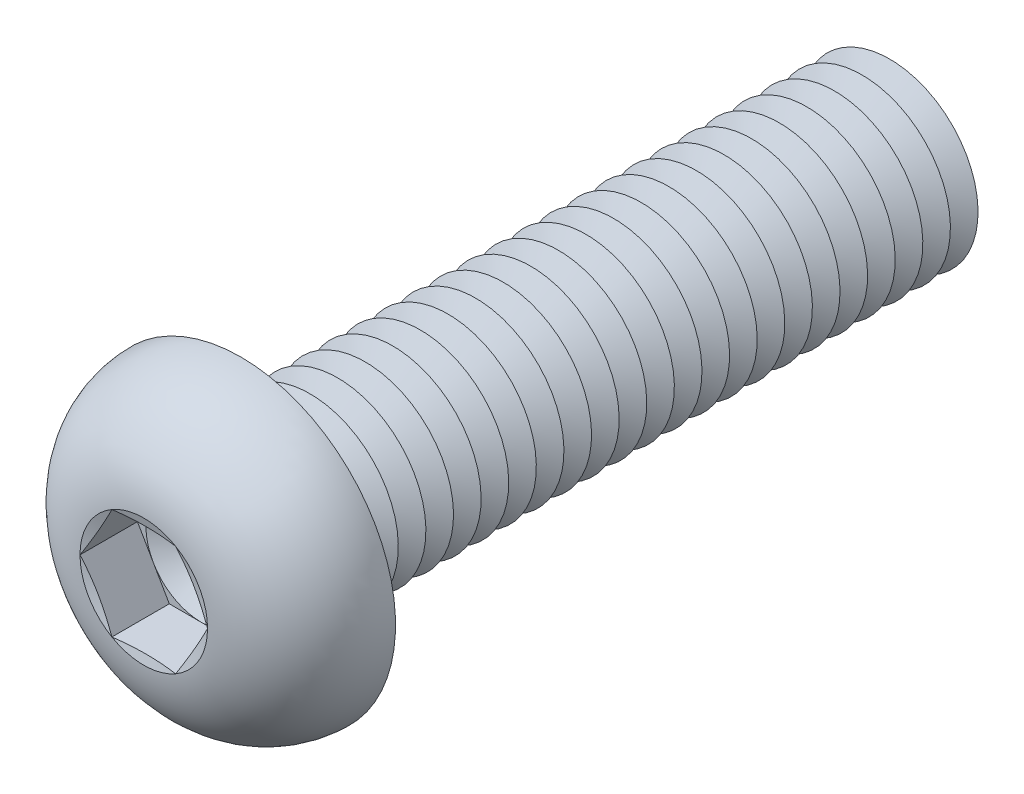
ISO-10303-21;
HEADER;
FILE_DESCRIPTION(('STEP AP214'),'2;1');
FILE_NAME('part.step','',(''),(''),'','','');
FILE_SCHEMA(('AUTOMOTIVE_DESIGN { 1 0 10303 214 1 1 1 1 }'));
ENDSEC;
DATA;
#1=APPLICATION_CONTEXT('core data for automotive mechanical design processes');
#2=APPLICATION_PROTOCOL_DEFINITION('international standard','automotive_design',2000,#1);
#3=PRODUCT_CONTEXT('',#1,'mechanical');
#4=PRODUCT('Part','Part','',(#3));
#5=PRODUCT_RELATED_PRODUCT_CATEGORY('part','',(#4));
#6=PRODUCT_DEFINITION_FORMATION('','',#4);
#7=PRODUCT_DEFINITION_CONTEXT('part definition',#1,'design');
#8=PRODUCT_DEFINITION('design','',#6,#7);
#9=PRODUCT_DEFINITION_SHAPE('','',#8);
#10=(LENGTH_UNIT() NAMED_UNIT(*) SI_UNIT(.MILLI.,.METRE.));
#11=(NAMED_UNIT(*) PLANE_ANGLE_UNIT() SI_UNIT($,.RADIAN.));
#12=(NAMED_UNIT(*) SI_UNIT($,.STERADIAN.) SOLID_ANGLE_UNIT());
#13=UNCERTAINTY_MEASURE_WITH_UNIT(LENGTH_MEASURE(1.E-05),#10,'distance_accuracy_value','');
#14=(GEOMETRIC_REPRESENTATION_CONTEXT(3) GLOBAL_UNCERTAINTY_ASSIGNED_CONTEXT((#13)) GLOBAL_UNIT_ASSIGNED_CONTEXT((#10,
#11,#12)) REPRESENTATION_CONTEXT('',''));
#15=CARTESIAN_POINT('',(0.,0.,0.));
#16=DIRECTION('',(0.,0.,1.));
#17=DIRECTION('',(1.,0.,0.));
#18=AXIS2_PLACEMENT_3D('',#15,#16,#17);
#19=CARTESIAN_POINT('',(0.,0.,1.8));
#20=DIRECTION('',(0.,0.,1.));
#21=DIRECTION('',(1.,0.,0.));
#22=AXIS2_PLACEMENT_3D('',#19,#20,#21);
#23=PLANE('',#22);
#24=CARTESIAN_POINT('',(0.,0.,1.8));
#25=DIRECTION('',(0.,0.,1.));
#26=DIRECTION('',(1.,0.,0.));
#27=AXIS2_PLACEMENT_3D('',#24,#25,#26);
#28=CIRCLE('',#27,2.49999883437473);
#29=CARTESIAN_POINT('',(2.1650625,1.24999941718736,1.8));
#30=VERTEX_POINT('',#29);
#31=CARTESIAN_POINT('',(0.,2.49999883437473,1.8));
#32=VERTEX_POINT('',#31);
#33=EDGE_CURVE('E118',#30,#32,#28,.T.);
#34=ORIENTED_EDGE('',*,*,#33,.F.);
#35=DIRECTION('',(-0.5,0.866025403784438,0.));
#36=VECTOR('',#35,1.);
#37=CARTESIAN_POINT('',(2.88675,0.,1.8));
#38=LINE('',#37,#36);
#39=CARTESIAN_POINT('',(1.443375,2.49999883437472,1.8));
#40=VERTEX_POINT('',#39);
#41=EDGE_CURVE('E125',#30,#40,#38,.T.);
#42=ORIENTED_EDGE('',*,*,#41,.T.);
#43=DIRECTION('',(-1.,0.,0.));
#44=VECTOR('',#43,1.);
#45=CARTESIAN_POINT('',(1.443375,2.49999883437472,1.8));
#46=LINE('',#45,#44);
#47=EDGE_CURVE('E136',#40,#32,#46,.T.);
#48=ORIENTED_EDGE('',*,*,#47,.T.);
#49=EDGE_LOOP('',(#34,#42,#48));
#50=FACE_BOUND('',#49,.T.);
#51=ADVANCED_FACE('F39',(#50),#23,.T.);
#52=CARTESIAN_POINT('',(0.,0.,1.8));
#53=DIRECTION('',(0.,0.,1.));
#54=DIRECTION('',(1.,0.,0.));
#55=AXIS2_PLACEMENT_3D('',#52,#53,#54);
#56=CIRCLE('',#55,2.49999883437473);
#57=CARTESIAN_POINT('',(-2.1650625,1.24999941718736,1.8));
#58=VERTEX_POINT('',#57);
#59=EDGE_CURVE('E11',#32,#58,#56,.T.);
#60=ORIENTED_EDGE('',*,*,#59,.F.);
#61=CARTESIAN_POINT('',(-1.443375,2.49999883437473,1.8));
#62=VERTEX_POINT('',#61);
#63=EDGE_CURVE('E131',#32,#62,#46,.T.);
#64=ORIENTED_EDGE('',*,*,#63,.T.);
#65=DIRECTION('',(-0.5,-0.866025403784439,0.));
#66=VECTOR('',#65,1.);
#67=CARTESIAN_POINT('',(-1.443375,2.49999883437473,1.8));
#68=LINE('',#67,#66);
#69=EDGE_CURVE('E134',#62,#58,#68,.T.);
#70=ORIENTED_EDGE('',*,*,#69,.T.);
#71=EDGE_LOOP('',(#60,#64,#70));
#72=FACE_BOUND('',#71,.T.);
#73=ADVANCED_FACE('F130',(#72),#23,.T.);
#74=CARTESIAN_POINT('',(-2.1650625,-1.24999941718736,1.8));
#75=VERTEX_POINT('',#74);
#76=EDGE_CURVE('E49',#58,#75,#56,.T.);
#77=ORIENTED_EDGE('',*,*,#76,.F.);
#78=CARTESIAN_POINT('',(-2.88675,0.,1.8));
#79=VERTEX_POINT('',#78);
#80=EDGE_CURVE('E143',#58,#79,#68,.T.);
#81=ORIENTED_EDGE('',*,*,#80,.T.);
#82=DIRECTION('',(0.5,-0.866025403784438,0.));
#83=VECTOR('',#82,1.);
#84=CARTESIAN_POINT('',(-2.88675,0.,1.8));
#85=LINE('',#84,#83);
#86=EDGE_CURVE('E151',#79,#75,#85,.T.);
#87=ORIENTED_EDGE('',*,*,#86,.T.);
#88=EDGE_LOOP('',(#77,#81,#87));
#89=FACE_BOUND('',#88,.T.);
#90=ADVANCED_FACE('F458',(#89),#23,.T.);
#91=CARTESIAN_POINT('',(0.,-2.49999883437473,1.8));
#92=VERTEX_POINT('',#91);
#93=EDGE_CURVE('E444',#75,#92,#56,.T.);
#94=ORIENTED_EDGE('',*,*,#93,.F.);
#95=CARTESIAN_POINT('',(-1.443375,-2.49999883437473,1.8));
#96=VERTEX_POINT('',#95);
#97=EDGE_CURVE('E150',#75,#96,#85,.T.);
#98=ORIENTED_EDGE('',*,*,#97,.T.);
#99=DIRECTION('',(1.,0.,0.));
#100=VECTOR('',#99,1.);
#101=CARTESIAN_POINT('',(-1.443375,-2.49999883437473,1.8));
#102=LINE('',#101,#100);
#103=EDGE_CURVE('E156',#96,#92,#102,.T.);
#104=ORIENTED_EDGE('',*,*,#103,.T.);
#105=EDGE_LOOP('',(#94,#98,#104));
#106=FACE_BOUND('',#105,.T.);
#107=ADVANCED_FACE('F452',(#106),#23,.T.);
#108=CARTESIAN_POINT('',(2.1650625,-1.24999941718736,1.8));
#109=VERTEX_POINT('',#108);
#110=EDGE_CURVE('E56',#92,#109,#56,.T.);
#111=ORIENTED_EDGE('',*,*,#110,.F.);
#112=CARTESIAN_POINT('',(1.443375,-2.49999883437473,1.8));
#113=VERTEX_POINT('',#112);
#114=EDGE_CURVE('E155',#92,#113,#102,.T.);
#115=ORIENTED_EDGE('',*,*,#114,.T.);
#116=DIRECTION('',(0.5,0.866025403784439,0.));
#117=VECTOR('',#116,1.);
#118=CARTESIAN_POINT('',(1.443375,-2.49999883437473,1.8));
#119=LINE('',#118,#117);
#120=EDGE_CURVE('E161',#113,#109,#119,.T.);
#121=ORIENTED_EDGE('',*,*,#120,.T.);
#122=EDGE_LOOP('',(#111,#115,#121));
#123=FACE_BOUND('',#122,.T.);
#124=ADVANCED_FACE('F527',(#123),#23,.T.);
#125=CARTESIAN_POINT('',(0.,0.,4.4));
#126=DIRECTION('',(0.,0.,1.));
#127=DIRECTION('',(0.,-1.,0.));
#128=AXIS2_PLACEMENT_3D('',#125,#126,#127);
#129=CONICAL_SURFACE('',#128,2.88675,1.30899693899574);
#130=CARTESIAN_POINT('',(2.88686547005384,-0.000200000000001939,4.40003094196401));
#131=CARTESIAN_POINT('',(2.82691617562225,0.103635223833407,4.3839595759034));
#132=CARTESIAN_POINT('',(2.76685817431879,0.20765873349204,4.36936933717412));
#133=CARTESIAN_POINT('',(2.64653003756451,0.416073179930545,4.3437355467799));
#134=CARTESIAN_POINT('',(2.58625982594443,0.520464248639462,4.33269343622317));
#135=CARTESIAN_POINT('',(2.46587274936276,0.72898078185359,4.31480063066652));
#136=CARTESIAN_POINT('',(2.40575669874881,0.833104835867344,4.3079285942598));
#137=CARTESIAN_POINT('',(2.28544792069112,1.04148575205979,4.29871388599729));
#138=CARTESIAN_POINT('',(2.22525521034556,1.14574258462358,4.29637033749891));
#139=CARTESIAN_POINT('',(2.10486978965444,1.35425624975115,4.29637033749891));
#140=CARTESIAN_POINT('',(2.04467707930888,1.45851308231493,4.29871388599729));
#141=CARTESIAN_POINT('',(1.92436830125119,1.66689399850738,4.3079285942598));
#142=CARTESIAN_POINT('',(1.86425225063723,1.77101805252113,4.31480063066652));
#143=CARTESIAN_POINT('',(1.74386517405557,1.97953458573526,4.33269343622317));
#144=CARTESIAN_POINT('',(1.68359496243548,2.08392565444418,4.3437355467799));
#145=CARTESIAN_POINT('',(1.56326682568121,2.29234010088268,4.36936933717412));
#146=CARTESIAN_POINT('',(1.50320882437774,2.39636361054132,4.3839595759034));
#147=CARTESIAN_POINT('',(1.44325952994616,2.50019883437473,4.40003094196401));
#148=B_SPLINE_CURVE_WITH_KNOTS('',3,(#130,#131,#132,#133,#134,#135,#136,#137,#138,#139,#140,
#141,#142,#143,#144,#145,#146,#147),.UNSPECIFIED.,.F.,.F.,(4,2,2,2,2,2,2,2,4),(0.,
0.362931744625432,0.726010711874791,1.08721550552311,1.44835036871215,1.80948523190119,
2.17069002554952,2.53376899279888,2.89670073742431),.UNSPECIFIED.);
#149=CARTESIAN_POINT('',(2.88675,0.,4.4));
#150=VERTEX_POINT('',#149);
#151=CARTESIAN_POINT('',(1.443375,2.49999883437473,4.4));
#152=VERTEX_POINT('',#151);
#153=EDGE_CURVE('E220',#150,#152,#148,.T.);
#154=ORIENTED_EDGE('',*,*,#153,.F.);
#155=CARTESIAN_POINT('',(0.,0.,4.4));
#156=DIRECTION('',(0.,0.,-1.));
#157=DIRECTION('',(0.,1.,0.));
#158=AXIS2_PLACEMENT_3D('',#155,#156,#157);
#159=CIRCLE('',#158,2.88675);
#160=EDGE_CURVE('E428',#152,#150,#159,.T.);
#161=ORIENTED_EDGE('',*,*,#160,.F.);
#162=EDGE_LOOP('',(#154,#161));
#163=FACE_BOUND('',#162,.T.);
#164=ADVANCED_FACE('F531',(#163),#129,.F.);
#165=CARTESIAN_POINT('',(1.44325952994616,-2.50019883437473,4.40003094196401));
#166=CARTESIAN_POINT('',(1.50320882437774,-2.39636361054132,4.3839595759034));
#167=CARTESIAN_POINT('',(1.56326682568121,-2.29234010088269,4.36936933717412));
#168=CARTESIAN_POINT('',(1.68359496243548,-2.08392565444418,4.3437355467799));
#169=CARTESIAN_POINT('',(1.74386517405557,-1.97953458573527,4.33269343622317));
#170=CARTESIAN_POINT('',(1.86425225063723,-1.77101805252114,4.31480063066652));
#171=CARTESIAN_POINT('',(1.92436830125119,-1.66689399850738,4.3079285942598));
#172=CARTESIAN_POINT('',(2.04467707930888,-1.45851308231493,4.29871388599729));
#173=CARTESIAN_POINT('',(2.10486978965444,-1.35425624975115,4.29637033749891));
#174=CARTESIAN_POINT('',(2.22525521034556,-1.14574258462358,4.29637033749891));
#175=CARTESIAN_POINT('',(2.28544792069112,-1.0414857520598,4.29871388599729));
#176=CARTESIAN_POINT('',(2.40575669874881,-0.833104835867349,4.3079285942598));
#177=CARTESIAN_POINT('',(2.46587274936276,-0.728980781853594,4.31480063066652));
#178=CARTESIAN_POINT('',(2.58625982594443,-0.520464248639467,4.33269343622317));
#179=CARTESIAN_POINT('',(2.64653003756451,-0.41607317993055,4.3437355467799));
#180=CARTESIAN_POINT('',(2.76685817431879,-0.207658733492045,4.36936933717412));
#181=CARTESIAN_POINT('',(2.82691617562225,-0.103635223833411,4.3839595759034));
#182=CARTESIAN_POINT('',(2.88686547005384,0.000199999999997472,4.40003094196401));
#183=B_SPLINE_CURVE_WITH_KNOTS('',3,(#165,#166,#167,#168,#169,#170,#171,#172,#173,#174,#175,
#176,#177,#178,#179,#180,#181,#182),.UNSPECIFIED.,.F.,.F.,(4,2,2,2,2,2,2,2,4),(0.,
0.362931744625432,0.726010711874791,1.08721550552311,1.44835036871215,1.80948523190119,
2.17069002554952,2.53376899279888,2.89670073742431),.UNSPECIFIED.);
#184=CARTESIAN_POINT('',(1.443375,-2.49999883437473,4.4));
#185=VERTEX_POINT('',#184);
#186=EDGE_CURVE('E229',#185,#150,#183,.T.);
#187=ORIENTED_EDGE('',*,*,#186,.F.);
#188=EDGE_CURVE('E433',#150,#185,#159,.T.);
#189=ORIENTED_EDGE('',*,*,#188,.F.);
#190=EDGE_LOOP('',(#187,#189));
#191=FACE_BOUND('',#190,.T.);
#192=ADVANCED_FACE('F492',(#191),#129,.F.);
#193=CARTESIAN_POINT('',(-4.35611719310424,-2.49999883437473,4.97227902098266));
#194=CARTESIAN_POINT('',(-4.25066509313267,-2.49999883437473,4.94777440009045));
#195=CARTESIAN_POINT('',(-4.14516541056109,-2.49999883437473,4.92347459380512));
#196=CARTESIAN_POINT('',(-3.93405094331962,-2.49999883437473,4.87537247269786));
#197=CARTESIAN_POINT('',(-3.82843615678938,-2.49999883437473,4.85157016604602));
#198=CARTESIAN_POINT('',(-3.5113534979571,-2.49999883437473,4.78103338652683));
#199=CARTESIAN_POINT('',(-3.29968815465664,-2.49999883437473,4.73517861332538));
#200=CARTESIAN_POINT('',(-2.87365524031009,-2.49999883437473,4.64645582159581));
#201=CARTESIAN_POINT('',(-2.65928093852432,-2.49999883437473,4.60361983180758));
#202=CARTESIAN_POINT('',(-2.22952626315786,-2.49999883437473,4.52311285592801));
#203=CARTESIAN_POINT('',(-2.01414580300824,-2.49999883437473,4.48544232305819));
#204=CARTESIAN_POINT('',(-1.58798319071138,-2.49999883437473,4.41876559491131));
#205=CARTESIAN_POINT('',(-1.37723418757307,-2.49999883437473,4.38955265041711));
#206=CARTESIAN_POINT('',(-0.954530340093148,-2.49999883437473,4.34171384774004));
#207=CARTESIAN_POINT('',(-0.742575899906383,-2.49999883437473,4.32308463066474));
#208=CARTESIAN_POINT('',(-0.424544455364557,-2.49999883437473,4.30539140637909));
#209=CARTESIAN_POINT('',(-0.318745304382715,-2.49999883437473,4.30120018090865));
#210=CARTESIAN_POINT('',(-0.107062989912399,-2.49999883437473,4.29638997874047));
#211=CARTESIAN_POINT('',(-0.00117982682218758,-2.49999883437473,4.29577098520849));
#212=CARTESIAN_POINT('',(0.210552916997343,-2.49999883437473,4.29814378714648));
#213=CARTESIAN_POINT('',(0.316402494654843,-2.49999883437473,4.30113585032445));
#214=CARTESIAN_POINT('',(0.527944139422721,-2.49999883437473,4.31057322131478));
#215=CARTESIAN_POINT('',(0.633636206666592,-2.49999883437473,4.31701852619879));
#216=CARTESIAN_POINT('',(0.890304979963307,-2.49999883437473,4.33652018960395));
#217=CARTESIAN_POINT('',(1.0411561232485,-2.49999883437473,4.35122885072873));
#218=CARTESIAN_POINT('',(1.34222474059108,-2.49999883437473,4.38593609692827));
#219=CARTESIAN_POINT('',(1.49244223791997,-2.49999883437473,4.40593448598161));
#220=CARTESIAN_POINT('',(1.79273634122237,-2.49999883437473,4.45011321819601));
#221=CARTESIAN_POINT('',(1.94281100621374,-2.49999883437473,4.47430656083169));
#222=CARTESIAN_POINT('',(2.24242097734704,-2.49999883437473,4.52583552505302));
#223=CARTESIAN_POINT('',(2.39195625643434,-2.49999883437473,4.55317130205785));
#224=CARTESIAN_POINT('',(2.69364402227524,-2.49999883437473,4.61079781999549));
#225=CARTESIAN_POINT('',(2.8457870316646,-2.49999883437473,4.64113779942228));
#226=CARTESIAN_POINT('',(3.14969016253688,-2.49999883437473,4.70367638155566));
#227=CARTESIAN_POINT('',(3.30145027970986,-2.49999883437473,4.73587500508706));
#228=CARTESIAN_POINT('',(3.60383766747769,-2.49999883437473,4.80150275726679));
#229=CARTESIAN_POINT('',(3.75446660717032,-2.49999883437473,4.83492423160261));
#230=CARTESIAN_POINT('',(4.05546753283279,-2.49999883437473,4.90285814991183));
#231=CARTESIAN_POINT('',(4.2058395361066,-2.49999883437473,4.9373705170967));
#232=CARTESIAN_POINT('',(4.35611719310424,-2.49999883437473,4.97227902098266));
#233=B_SPLINE_CURVE_WITH_KNOTS('',3,(#193,#194,#195,#196,#197,#198,#199,#200,#201,#202,#203,
#204,#205,#206,#207,#208,#209,#210,#211,#212,#213,#214,#215,#216,#217,#218,#219,#220,#221,#222,
#223,#224,#225,#226,#227,#228,#229,#230,#231,#232),.UNSPECIFIED.,.F.,.F.,(4,2,2,2,2,2,2,2,2,2,2,
2,2,2,2,2,2,2,2,4),(0.,0.324785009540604,0.6495753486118,1.29928181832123,1.95507889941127,
2.61093348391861,3.24905289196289,3.88696967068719,4.204563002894,4.5221548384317,
4.83977022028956,5.15738533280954,5.61196030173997,6.06651842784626,6.52251118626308,
6.97852650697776,7.44392737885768,7.90933346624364,8.37220553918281,8.83504510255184),.UNSPECIFIED.);
#234=CARTESIAN_POINT('',(-1.443375,-2.49999883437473,4.4));
#235=VERTEX_POINT('',#234);
#236=EDGE_CURVE('E471',#235,#185,#233,.T.);
#237=ORIENTED_EDGE('',*,*,#236,.F.);
#238=EDGE_CURVE('E484',#185,#235,#159,.T.);
#239=ORIENTED_EDGE('',*,*,#238,.F.);
#240=EDGE_LOOP('',(#237,#239));
#241=FACE_BOUND('',#240,.T.);
#242=ADVANCED_FACE('F498',(#241),#129,.F.);
#243=CARTESIAN_POINT('',(-2.88686547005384,0.00019999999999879,4.40003094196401));
#244=CARTESIAN_POINT('',(-2.82691617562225,-0.10363522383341,4.3839595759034));
#245=CARTESIAN_POINT('',(-2.76685817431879,-0.207658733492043,4.36936933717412));
#246=CARTESIAN_POINT('',(-2.64653003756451,-0.416073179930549,4.3437355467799));
#247=CARTESIAN_POINT('',(-2.58625982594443,-0.520464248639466,4.33269343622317));
#248=CARTESIAN_POINT('',(-2.46587274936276,-0.728980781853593,4.31480063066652));
#249=CARTESIAN_POINT('',(-2.40575669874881,-0.833104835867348,4.3079285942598));
#250=CARTESIAN_POINT('',(-2.28544792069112,-1.0414857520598,4.29871388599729));
#251=CARTESIAN_POINT('',(-2.22525521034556,-1.14574258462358,4.29637033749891));
#252=CARTESIAN_POINT('',(-2.10486978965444,-1.35425624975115,4.29637033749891));
#253=CARTESIAN_POINT('',(-2.04467707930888,-1.45851308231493,4.29871388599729));
#254=CARTESIAN_POINT('',(-1.92436830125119,-1.66689399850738,4.3079285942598));
#255=CARTESIAN_POINT('',(-1.86425225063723,-1.77101805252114,4.31480063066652));
#256=CARTESIAN_POINT('',(-1.74386517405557,-1.97953458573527,4.33269343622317));
#257=CARTESIAN_POINT('',(-1.68359496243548,-2.08392565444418,4.3437355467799));
#258=CARTESIAN_POINT('',(-1.56326682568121,-2.29234010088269,4.36936933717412));
#259=CARTESIAN_POINT('',(-1.50320882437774,-2.39636361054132,4.3839595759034));
#260=CARTESIAN_POINT('',(-1.44325952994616,-2.50019883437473,4.40003094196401));
#261=B_SPLINE_CURVE_WITH_KNOTS('',3,(#243,#244,#245,#246,#247,#248,#249,#250,#251,#252,#253,
#254,#255,#256,#257,#258,#259,#260),.UNSPECIFIED.,.F.,.F.,(4,2,2,2,2,2,2,2,4),(0.,
0.362931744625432,0.726010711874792,1.08721550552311,1.44835036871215,1.80948523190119,
2.17069002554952,2.53376899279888,2.89670073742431),.UNSPECIFIED.);
#262=CARTESIAN_POINT('',(-2.88675,0.,4.4));
#263=VERTEX_POINT('',#262);
#264=EDGE_CURVE('E463',#263,#235,#261,.T.);
#265=ORIENTED_EDGE('',*,*,#264,.F.);
#266=EDGE_CURVE('E469',#235,#263,#159,.T.);
#267=ORIENTED_EDGE('',*,*,#266,.F.);
#268=EDGE_LOOP('',(#265,#267));
#269=FACE_BOUND('',#268,.T.);
#270=ADVANCED_FACE('F467',(#269),#129,.F.);
#271=CARTESIAN_POINT('',(-1.44325952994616,2.50019883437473,4.40003094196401));
#272=CARTESIAN_POINT('',(-1.50320882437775,2.39636361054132,4.3839595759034));
#273=CARTESIAN_POINT('',(-1.56326682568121,2.29234010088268,4.36936933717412));
#274=CARTESIAN_POINT('',(-1.68359496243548,2.08392565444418,4.3437355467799));
#275=CARTESIAN_POINT('',(-1.74386517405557,1.97953458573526,4.33269343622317));
#276=CARTESIAN_POINT('',(-1.86425225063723,1.77101805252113,4.31480063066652));
#277=CARTESIAN_POINT('',(-1.92436830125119,1.66689399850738,4.3079285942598));
#278=CARTESIAN_POINT('',(-2.04467707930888,1.45851308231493,4.29871388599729));
#279=CARTESIAN_POINT('',(-2.10486978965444,1.35425624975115,4.29637033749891));
#280=CARTESIAN_POINT('',(-2.22525521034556,1.14574258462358,4.29637033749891));
#281=CARTESIAN_POINT('',(-2.28544792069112,1.04148575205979,4.29871388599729));
#282=CARTESIAN_POINT('',(-2.40575669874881,0.833104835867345,4.3079285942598));
#283=CARTESIAN_POINT('',(-2.46587274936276,0.728980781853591,4.31480063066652));
#284=CARTESIAN_POINT('',(-2.58625982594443,0.520464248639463,4.33269343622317));
#285=CARTESIAN_POINT('',(-2.64653003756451,0.416073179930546,4.3437355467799));
#286=CARTESIAN_POINT('',(-2.76685817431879,0.207658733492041,4.36936933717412));
#287=CARTESIAN_POINT('',(-2.82691617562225,0.103635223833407,4.3839595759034));
#288=CARTESIAN_POINT('',(-2.88686547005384,-0.000200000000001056,4.40003094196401));
#289=B_SPLINE_CURVE_WITH_KNOTS('',3,(#271,#272,#273,#274,#275,#276,#277,#278,#279,#280,#281,
#282,#283,#284,#285,#286,#287,#288),.UNSPECIFIED.,.F.,.F.,(4,2,2,2,2,2,2,2,4),(0.,
0.362931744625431,0.72601071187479,1.08721550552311,1.44835036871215,1.80948523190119,
2.17069002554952,2.53376899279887,2.89670073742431),.UNSPECIFIED.);
#290=CARTESIAN_POINT('',(-1.443375,2.49999883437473,4.4));
#291=VERTEX_POINT('',#290);
#292=EDGE_CURVE('E194',#291,#263,#289,.T.);
#293=ORIENTED_EDGE('',*,*,#292,.F.);
#294=EDGE_CURVE('E474',#263,#291,#159,.T.);
#295=ORIENTED_EDGE('',*,*,#294,.F.);
#296=EDGE_LOOP('',(#293,#295));
#297=FACE_BOUND('',#296,.T.);
#298=ADVANCED_FACE('F475',(#297),#129,.F.);
#299=CARTESIAN_POINT('',(0.,0.,-25.625));
#300=DIRECTION('',(0.,0.,1.));
#301=DIRECTION('',(0.,-1.,0.));
#302=AXIS2_PLACEMENT_3D('',#299,#300,#301);
#303=CONICAL_SURFACE('',#302,3.99999999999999,1.0471975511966);
#304=CARTESIAN_POINT('',(0.,0.,-26.25));
#305=DIRECTION('',(0.,0.,1.));
#306=DIRECTION('',(0.,-1.,0.));
#307=AXIS2_PLACEMENT_3D('',#304,#305,#306);
#308=CIRCLE('',#307,2.91746824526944);
#309=CARTESIAN_POINT('',(0.,-2.91746824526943,-26.25));
#310=VERTEX_POINT('',#309);
#311=EDGE_CURVE('E399',#310,#310,#308,.T.);
#312=ORIENTED_EDGE('',*,*,#311,.T.);
#313=EDGE_LOOP('',(#312));
#314=FACE_BOUND('',#313,.T.);
#315=CARTESIAN_POINT('',(0.,0.,-25.625));
#316=DIRECTION('',(0.,0.,1.));
#317=DIRECTION('',(0.,-1.,0.));
#318=AXIS2_PLACEMENT_3D('',#315,#316,#317);
#319=CIRCLE('',#318,3.99999999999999);
#320=CARTESIAN_POINT('',(0.,-3.99999999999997,-25.625));
#321=VERTEX_POINT('',#320);
#322=EDGE_CURVE('E395',#321,#321,#319,.T.);
#323=ORIENTED_EDGE('',*,*,#322,.F.);
#324=EDGE_LOOP('',(#323));
#325=FACE_BOUND('',#324,.T.);
#326=ADVANCED_FACE('F556',(#314,#325),#303,.T.);
#327=CARTESIAN_POINT('',(0.,0.,-26.25));
#328=DIRECTION('',(0.,0.,-1.));
#329=DIRECTION('',(0.,1.,0.));
#330=AXIS2_PLACEMENT_3D('',#327,#328,#329);
#331=CONICAL_SURFACE('',#330,2.91746824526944,1.0471975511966);
#332=CARTESIAN_POINT('',(0.,0.,-26.875));
#333=DIRECTION('',(0.,0.,1.));
#334=DIRECTION('',(0.,-1.,0.));
#335=AXIS2_PLACEMENT_3D('',#332,#333,#334);
#336=CIRCLE('',#335,3.99999999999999);
#337=CARTESIAN_POINT('',(0.,-3.99999999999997,-26.875));
#338=VERTEX_POINT('',#337);
#339=EDGE_CURVE('E403',#338,#338,#336,.T.);
#340=ORIENTED_EDGE('',*,*,#339,.T.);
#341=EDGE_LOOP('',(#340));
#342=FACE_BOUND('',#341,.T.);
#343=ORIENTED_EDGE('',*,*,#311,.F.);
#344=EDGE_LOOP('',(#343));
#345=FACE_BOUND('',#344,.T.);
#346=ADVANCED_FACE('F561',(#342,#345),#331,.T.);
#347=CARTESIAN_POINT('',(0.,4.,-30.));
#348=DIRECTION('',(0.,0.,-1.));
#349=DIRECTION('',(0.,1.,0.));
#350=AXIS2_PLACEMENT_3D('',#347,#348,#349);
#351=PLANE('',#350);
#352=CARTESIAN_POINT('',(0.,0.,-30.));
#353=DIRECTION('',(0.,0.,1.));
#354=DIRECTION('',(0.,-1.,0.));
#355=AXIS2_PLACEMENT_3D('',#352,#353,#354);
#356=CIRCLE('',#355,2.91746824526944);
#357=CARTESIAN_POINT('',(0.,-2.91746824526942,-30.));
#358=VERTEX_POINT('',#357);
#359=EDGE_CURVE('E423',#358,#358,#356,.T.);
#360=ORIENTED_EDGE('',*,*,#359,.F.);
#361=EDGE_LOOP('',(#360));
#362=FACE_BOUND('',#361,.T.);
#363=ADVANCED_FACE('F728',(#362),#351,.T.);
#364=CARTESIAN_POINT('',(0.,0.,-29.375));
#365=DIRECTION('',(0.,0.,1.));
#366=DIRECTION('',(0.,-1.,0.));
#367=AXIS2_PLACEMENT_3D('',#364,#365,#366);
#368=CONICAL_SURFACE('',#367,3.99999999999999,1.0471975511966);
#369=ORIENTED_EDGE('',*,*,#359,.T.);
#370=EDGE_LOOP('',(#369));
#371=FACE_BOUND('',#370,.T.);
#372=CARTESIAN_POINT('',(0.,0.,-29.375));
#373=DIRECTION('',(0.,0.,1.));
#374=DIRECTION('',(0.,-1.,0.));
#375=AXIS2_PLACEMENT_3D('',#372,#373,#374);
#376=CIRCLE('',#375,3.99999999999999);
#377=CARTESIAN_POINT('',(0.,-3.99999999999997,-29.375));
#378=VERTEX_POINT('',#377);
#379=EDGE_CURVE('E419',#378,#378,#376,.T.);
#380=ORIENTED_EDGE('',*,*,#379,.F.);
#381=EDGE_LOOP('',(#380));
#382=FACE_BOUND('',#381,.T.);
#383=ADVANCED_FACE('F721',(#371,#382),#368,.T.);
#384=CARTESIAN_POINT('',(0.,0.,-28.75));
#385=DIRECTION('',(0.,0.,-1.));
#386=DIRECTION('',(0.,1.,0.));
#387=AXIS2_PLACEMENT_3D('',#384,#385,#386);
#388=CONICAL_SURFACE('',#387,2.91746824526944,1.0471975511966);
#389=ORIENTED_EDGE('',*,*,#379,.T.);
#390=EDGE_LOOP('',(#389));
#391=FACE_BOUND('',#390,.T.);
#392=CARTESIAN_POINT('',(0.,0.,-28.75));
#393=DIRECTION('',(0.,0.,1.));
#394=DIRECTION('',(0.,-1.,0.));
#395=AXIS2_PLACEMENT_3D('',#392,#393,#394);
#396=CIRCLE('',#395,2.91746824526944);
#397=CARTESIAN_POINT('',(0.,-2.91746824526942,-28.75));
#398=VERTEX_POINT('',#397);
#399=EDGE_CURVE('E415',#398,#398,#396,.T.);
#400=ORIENTED_EDGE('',*,*,#399,.F.);
#401=EDGE_LOOP('',(#400));
#402=FACE_BOUND('',#401,.T.);
#403=ADVANCED_FACE('F727',(#391,#402),#388,.T.);
#404=CARTESIAN_POINT('',(0.,0.,-28.125));
#405=DIRECTION('',(0.,0.,1.));
#406=DIRECTION('',(0.,-1.,0.));
#407=AXIS2_PLACEMENT_3D('',#404,#405,#406);
#408=CONICAL_SURFACE('',#407,3.99999999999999,1.0471975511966);
#409=ORIENTED_EDGE('',*,*,#399,.T.);
#410=EDGE_LOOP('',(#409));
#411=FACE_BOUND('',#410,.T.);
#412=CARTESIAN_POINT('',(0.,0.,-28.125));
#413=DIRECTION('',(0.,0.,1.));
#414=DIRECTION('',(0.,-1.,0.));
#415=AXIS2_PLACEMENT_3D('',#412,#413,#414);
#416=CIRCLE('',#415,3.99999999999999);
#417=CARTESIAN_POINT('',(0.,-3.99999999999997,-28.125));
#418=VERTEX_POINT('',#417);
#419=EDGE_CURVE('E411',#418,#418,#416,.T.);
#420=ORIENTED_EDGE('',*,*,#419,.F.);
#421=EDGE_LOOP('',(#420));
#422=FACE_BOUND('',#421,.T.);
#423=ADVANCED_FACE('F759',(#411,#422),#408,.T.);
#424=CARTESIAN_POINT('',(0.,0.,-27.5));
#425=DIRECTION('',(0.,0.,-1.));
#426=DIRECTION('',(0.,1.,0.));
#427=AXIS2_PLACEMENT_3D('',#424,#425,#426);
#428=CONICAL_SURFACE('',#427,2.91746824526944,1.0471975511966);
#429=ORIENTED_EDGE('',*,*,#419,.T.);
#430=EDGE_LOOP('',(#429));
#431=FACE_BOUND('',#430,.T.);
#432=CARTESIAN_POINT('',(0.,0.,-27.5));
#433=DIRECTION('',(0.,0.,1.));
#434=DIRECTION('',(0.,-1.,0.));
#435=AXIS2_PLACEMENT_3D('',#432,#433,#434);
#436=CIRCLE('',#435,2.91746824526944);
#437=CARTESIAN_POINT('',(0.,-2.91746824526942,-27.5));
#438=VERTEX_POINT('',#437);
#439=EDGE_CURVE('E407',#438,#438,#436,.T.);
#440=ORIENTED_EDGE('',*,*,#439,.F.);
#441=EDGE_LOOP('',(#440));
#442=FACE_BOUND('',#441,.T.);
#443=ADVANCED_FACE('F769',(#431,#442),#428,.T.);
#444=CARTESIAN_POINT('',(0.,0.,-26.875));
#445=DIRECTION('',(0.,0.,1.));
#446=DIRECTION('',(0.,-1.,0.));
#447=AXIS2_PLACEMENT_3D('',#444,#445,#446);
#448=CONICAL_SURFACE('',#447,3.99999999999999,1.0471975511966);
#449=ORIENTED_EDGE('',*,*,#439,.T.);
#450=EDGE_LOOP('',(#449));
#451=FACE_BOUND('',#450,.T.);
#452=ORIENTED_EDGE('',*,*,#339,.F.);
#453=EDGE_LOOP('',(#452));
#454=FACE_BOUND('',#453,.T.);
#455=ADVANCED_FACE('F779',(#451,#454),#448,.T.);
#456=CARTESIAN_POINT('',(0.,0.,-24.375));
#457=DIRECTION('',(0.,0.,1.));
#458=DIRECTION('',(0.,-1.,0.));
#459=AXIS2_PLACEMENT_3D('',#456,#457,#458);
#460=CONICAL_SURFACE('',#459,3.99999999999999,1.0471975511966);
#461=CARTESIAN_POINT('',(0.,0.,-25.));
#462=DIRECTION('',(0.,0.,1.));
#463=DIRECTION('',(0.,-1.,0.));
#464=AXIS2_PLACEMENT_3D('',#461,#462,#463);
#465=CIRCLE('',#464,2.91746824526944);
#466=CARTESIAN_POINT('',(0.,-2.91746824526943,-25.));
#467=VERTEX_POINT('',#466);
#468=EDGE_CURVE('E391',#467,#467,#465,.T.);
#469=ORIENTED_EDGE('',*,*,#468,.T.);
#470=EDGE_LOOP('',(#469));
#471=FACE_BOUND('',#470,.T.);
#472=CARTESIAN_POINT('',(0.,0.,-24.375));
#473=DIRECTION('',(0.,0.,1.));
#474=DIRECTION('',(0.,-1.,0.));
#475=AXIS2_PLACEMENT_3D('',#472,#473,#474);
#476=CIRCLE('',#475,3.99999999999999);
#477=CARTESIAN_POINT('',(0.,-3.99999999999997,-24.375));
#478=VERTEX_POINT('',#477);
#479=EDGE_CURVE('E387',#478,#478,#476,.T.);
#480=ORIENTED_EDGE('',*,*,#479,.F.);
#481=EDGE_LOOP('',(#480));
#482=FACE_BOUND('',#481,.T.);
#483=ADVANCED_FACE('F789',(#471,#482),#460,.T.);
#484=CARTESIAN_POINT('',(0.,0.,-25.));
#485=DIRECTION('',(0.,0.,-1.));
#486=DIRECTION('',(0.,1.,0.));
#487=AXIS2_PLACEMENT_3D('',#484,#485,#486);
#488=CONICAL_SURFACE('',#487,2.91746824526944,1.0471975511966);
#489=ORIENTED_EDGE('',*,*,#322,.T.);
#490=EDGE_LOOP('',(#489));
#491=FACE_BOUND('',#490,.T.);
#492=ORIENTED_EDGE('',*,*,#468,.F.);
#493=EDGE_LOOP('',(#492));
#494=FACE_BOUND('',#493,.T.);
#495=ADVANCED_FACE('F799',(#491,#494),#488,.T.);
#496=CARTESIAN_POINT('',(0.,0.,-23.125));
#497=DIRECTION('',(0.,0.,1.));
#498=DIRECTION('',(0.,-1.,0.));
#499=AXIS2_PLACEMENT_3D('',#496,#497,#498);
#500=CONICAL_SURFACE('',#499,3.99999999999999,1.0471975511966);
#501=CARTESIAN_POINT('',(0.,0.,-23.75));
#502=DIRECTION('',(0.,0.,1.));
#503=DIRECTION('',(0.,-1.,0.));
#504=AXIS2_PLACEMENT_3D('',#501,#502,#503);
#505=CIRCLE('',#504,2.91746824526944);
#506=CARTESIAN_POINT('',(0.,-2.91746824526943,-23.75));
#507=VERTEX_POINT('',#506);
#508=EDGE_CURVE('E383',#507,#507,#505,.T.);
#509=ORIENTED_EDGE('',*,*,#508,.T.);
#510=EDGE_LOOP('',(#509));
#511=FACE_BOUND('',#510,.T.);
#512=CARTESIAN_POINT('',(0.,0.,-23.125));
#513=DIRECTION('',(0.,0.,1.));
#514=DIRECTION('',(0.,-1.,0.));
#515=AXIS2_PLACEMENT_3D('',#512,#513,#514);
#516=CIRCLE('',#515,3.99999999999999);
#517=CARTESIAN_POINT('',(0.,-3.99999999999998,-23.125));
#518=VERTEX_POINT('',#517);
#519=EDGE_CURVE('E379',#518,#518,#516,.T.);
#520=ORIENTED_EDGE('',*,*,#519,.F.);
#521=EDGE_LOOP('',(#520));
#522=FACE_BOUND('',#521,.T.);
#523=ADVANCED_FACE('F809',(#511,#522),#500,.T.);
#524=CARTESIAN_POINT('',(0.,0.,-23.75));
#525=DIRECTION('',(0.,0.,-1.));
#526=DIRECTION('',(0.,1.,0.));
#527=AXIS2_PLACEMENT_3D('',#524,#525,#526);
#528=CONICAL_SURFACE('',#527,2.91746824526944,1.0471975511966);
#529=ORIENTED_EDGE('',*,*,#479,.T.);
#530=EDGE_LOOP('',(#529));
#531=FACE_BOUND('',#530,.T.);
#532=ORIENTED_EDGE('',*,*,#508,.F.);
#533=EDGE_LOOP('',(#532));
#534=FACE_BOUND('',#533,.T.);
#535=ADVANCED_FACE('F819',(#531,#534),#528,.T.);
#536=CARTESIAN_POINT('',(0.,0.,-21.875));
#537=DIRECTION('',(0.,0.,1.));
#538=DIRECTION('',(0.,-1.,0.));
#539=AXIS2_PLACEMENT_3D('',#536,#537,#538);
#540=CONICAL_SURFACE('',#539,3.99999999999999,1.0471975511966);
#541=CARTESIAN_POINT('',(0.,0.,-22.5));
#542=DIRECTION('',(0.,0.,1.));
#543=DIRECTION('',(0.,-1.,0.));
#544=AXIS2_PLACEMENT_3D('',#541,#542,#543);
#545=CIRCLE('',#544,2.91746824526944);
#546=CARTESIAN_POINT('',(0.,-2.91746824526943,-22.5));
#547=VERTEX_POINT('',#546);
#548=EDGE_CURVE('E375',#547,#547,#545,.T.);
#549=ORIENTED_EDGE('',*,*,#548,.T.);
#550=EDGE_LOOP('',(#549));
#551=FACE_BOUND('',#550,.T.);
#552=CARTESIAN_POINT('',(0.,0.,-21.875));
#553=DIRECTION('',(0.,0.,1.));
#554=DIRECTION('',(0.,-1.,0.));
#555=AXIS2_PLACEMENT_3D('',#552,#553,#554);
#556=CIRCLE('',#555,3.99999999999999);
#557=CARTESIAN_POINT('',(0.,-3.99999999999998,-21.875));
#558=VERTEX_POINT('',#557);
#559=EDGE_CURVE('E371',#558,#558,#556,.T.);
#560=ORIENTED_EDGE('',*,*,#559,.F.);
#561=EDGE_LOOP('',(#560));
#562=FACE_BOUND('',#561,.T.);
#563=ADVANCED_FACE('F829',(#551,#562),#540,.T.);
#564=CARTESIAN_POINT('',(0.,0.,-22.5));
#565=DIRECTION('',(0.,0.,-1.));
#566=DIRECTION('',(0.,1.,0.));
#567=AXIS2_PLACEMENT_3D('',#564,#565,#566);
#568=CONICAL_SURFACE('',#567,2.91746824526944,1.0471975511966);
#569=ORIENTED_EDGE('',*,*,#519,.T.);
#570=EDGE_LOOP('',(#569));
#571=FACE_BOUND('',#570,.T.);
#572=ORIENTED_EDGE('',*,*,#548,.F.);
#573=EDGE_LOOP('',(#572));
#574=FACE_BOUND('',#573,.T.);
#575=ADVANCED_FACE('F839',(#571,#574),#568,.T.);
#576=CARTESIAN_POINT('',(0.,0.,-20.625));
#577=DIRECTION('',(0.,0.,1.));
#578=DIRECTION('',(0.,-1.,0.));
#579=AXIS2_PLACEMENT_3D('',#576,#577,#578);
#580=CONICAL_SURFACE('',#579,3.99999999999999,1.0471975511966);
#581=CARTESIAN_POINT('',(0.,0.,-21.25));
#582=DIRECTION('',(0.,0.,1.));
#583=DIRECTION('',(0.,-1.,0.));
#584=AXIS2_PLACEMENT_3D('',#581,#582,#583);
#585=CIRCLE('',#584,2.91746824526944);
#586=CARTESIAN_POINT('',(0.,-2.91746824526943,-21.25));
#587=VERTEX_POINT('',#586);
#588=EDGE_CURVE('E367',#587,#587,#585,.T.);
#589=ORIENTED_EDGE('',*,*,#588,.T.);
#590=EDGE_LOOP('',(#589));
#591=FACE_BOUND('',#590,.T.);
#592=CARTESIAN_POINT('',(0.,0.,-20.625));
#593=DIRECTION('',(0.,0.,1.));
#594=DIRECTION('',(0.,-1.,0.));
#595=AXIS2_PLACEMENT_3D('',#592,#593,#594);
#596=CIRCLE('',#595,3.99999999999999);
#597=CARTESIAN_POINT('',(0.,-3.99999999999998,-20.625));
#598=VERTEX_POINT('',#597);
#599=EDGE_CURVE('E363',#598,#598,#596,.T.);
#600=ORIENTED_EDGE('',*,*,#599,.F.);
#601=EDGE_LOOP('',(#600));
#602=FACE_BOUND('',#601,.T.);
#603=ADVANCED_FACE('F849',(#591,#602),#580,.T.);
#604=CARTESIAN_POINT('',(0.,0.,-21.25));
#605=DIRECTION('',(0.,0.,-1.));
#606=DIRECTION('',(0.,1.,0.));
#607=AXIS2_PLACEMENT_3D('',#604,#605,#606);
#608=CONICAL_SURFACE('',#607,2.91746824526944,1.0471975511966);
#609=ORIENTED_EDGE('',*,*,#559,.T.);
#610=EDGE_LOOP('',(#609));
#611=FACE_BOUND('',#610,.T.);
#612=ORIENTED_EDGE('',*,*,#588,.F.);
#613=EDGE_LOOP('',(#612));
#614=FACE_BOUND('',#613,.T.);
#615=ADVANCED_FACE('F859',(#611,#614),#608,.T.);
#616=CARTESIAN_POINT('',(0.,0.,-19.375));
#617=DIRECTION('',(0.,0.,1.));
#618=DIRECTION('',(0.,-1.,0.));
#619=AXIS2_PLACEMENT_3D('',#616,#617,#618);
#620=CONICAL_SURFACE('',#619,3.99999999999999,1.0471975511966);
#621=CARTESIAN_POINT('',(0.,0.,-20.));
#622=DIRECTION('',(0.,0.,1.));
#623=DIRECTION('',(0.,-1.,0.));
#624=AXIS2_PLACEMENT_3D('',#621,#622,#623);
#625=CIRCLE('',#624,2.91746824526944);
#626=CARTESIAN_POINT('',(0.,-2.91746824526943,-20.));
#627=VERTEX_POINT('',#626);
#628=EDGE_CURVE('E359',#627,#627,#625,.T.);
#629=ORIENTED_EDGE('',*,*,#628,.T.);
#630=EDGE_LOOP('',(#629));
#631=FACE_BOUND('',#630,.T.);
#632=CARTESIAN_POINT('',(0.,0.,-19.375));
#633=DIRECTION('',(0.,0.,1.));
#634=DIRECTION('',(0.,-1.,0.));
#635=AXIS2_PLACEMENT_3D('',#632,#633,#634);
#636=CIRCLE('',#635,3.99999999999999);
#637=CARTESIAN_POINT('',(0.,-3.99999999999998,-19.375));
#638=VERTEX_POINT('',#637);
#639=EDGE_CURVE('E355',#638,#638,#636,.T.);
#640=ORIENTED_EDGE('',*,*,#639,.F.);
#641=EDGE_LOOP('',(#640));
#642=FACE_BOUND('',#641,.T.);
#643=ADVANCED_FACE('F869',(#631,#642),#620,.T.);
#644=CARTESIAN_POINT('',(0.,0.,-20.));
#645=DIRECTION('',(0.,0.,-1.));
#646=DIRECTION('',(0.,1.,0.));
#647=AXIS2_PLACEMENT_3D('',#644,#645,#646);
#648=CONICAL_SURFACE('',#647,2.91746824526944,1.0471975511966);
#649=ORIENTED_EDGE('',*,*,#599,.T.);
#650=EDGE_LOOP('',(#649));
#651=FACE_BOUND('',#650,.T.);
#652=ORIENTED_EDGE('',*,*,#628,.F.);
#653=EDGE_LOOP('',(#652));
#654=FACE_BOUND('',#653,.T.);
#655=ADVANCED_FACE('F879',(#651,#654),#648,.T.);
#656=CARTESIAN_POINT('',(0.,0.,-18.125));
#657=DIRECTION('',(0.,0.,1.));
#658=DIRECTION('',(0.,-1.,0.));
#659=AXIS2_PLACEMENT_3D('',#656,#657,#658);
#660=CONICAL_SURFACE('',#659,3.99999999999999,1.0471975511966);
#661=CARTESIAN_POINT('',(0.,0.,-18.75));
#662=DIRECTION('',(0.,0.,1.));
#663=DIRECTION('',(0.,-1.,0.));
#664=AXIS2_PLACEMENT_3D('',#661,#662,#663);
#665=CIRCLE('',#664,2.91746824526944);
#666=CARTESIAN_POINT('',(0.,-2.91746824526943,-18.75));
#667=VERTEX_POINT('',#666);
#668=EDGE_CURVE('E351',#667,#667,#665,.T.);
#669=ORIENTED_EDGE('',*,*,#668,.T.);
#670=EDGE_LOOP('',(#669));
#671=FACE_BOUND('',#670,.T.);
#672=CARTESIAN_POINT('',(0.,0.,-18.125));
#673=DIRECTION('',(0.,0.,1.));
#674=DIRECTION('',(0.,-1.,0.));
#675=AXIS2_PLACEMENT_3D('',#672,#673,#674);
#676=CIRCLE('',#675,3.99999999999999);
#677=CARTESIAN_POINT('',(0.,-3.99999999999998,-18.125));
#678=VERTEX_POINT('',#677);
#679=EDGE_CURVE('E347',#678,#678,#676,.T.);
#680=ORIENTED_EDGE('',*,*,#679,.F.);
#681=EDGE_LOOP('',(#680));
#682=FACE_BOUND('',#681,.T.);
#683=ADVANCED_FACE('F889',(#671,#682),#660,.T.);
#684=CARTESIAN_POINT('',(0.,0.,-18.75));
#685=DIRECTION('',(0.,0.,-1.));
#686=DIRECTION('',(0.,1.,0.));
#687=AXIS2_PLACEMENT_3D('',#684,#685,#686);
#688=CONICAL_SURFACE('',#687,2.91746824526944,1.0471975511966);
#689=ORIENTED_EDGE('',*,*,#639,.T.);
#690=EDGE_LOOP('',(#689));
#691=FACE_BOUND('',#690,.T.);
#692=ORIENTED_EDGE('',*,*,#668,.F.);
#693=EDGE_LOOP('',(#692));
#694=FACE_BOUND('',#693,.T.);
#695=ADVANCED_FACE('F899',(#691,#694),#688,.T.);
#696=CARTESIAN_POINT('',(0.,0.,-16.875));
#697=DIRECTION('',(0.,0.,1.));
#698=DIRECTION('',(0.,-1.,0.));
#699=AXIS2_PLACEMENT_3D('',#696,#697,#698);
#700=CONICAL_SURFACE('',#699,3.99999999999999,1.0471975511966);
#701=CARTESIAN_POINT('',(0.,0.,-17.5));
#702=DIRECTION('',(0.,0.,1.));
#703=DIRECTION('',(0.,-1.,0.));
#704=AXIS2_PLACEMENT_3D('',#701,#702,#703);
#705=CIRCLE('',#704,2.91746824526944);
#706=CARTESIAN_POINT('',(0.,-2.91746824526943,-17.5));
#707=VERTEX_POINT('',#706);
#708=EDGE_CURVE('E343',#707,#707,#705,.T.);
#709=ORIENTED_EDGE('',*,*,#708,.T.);
#710=EDGE_LOOP('',(#709));
#711=FACE_BOUND('',#710,.T.);
#712=CARTESIAN_POINT('',(0.,0.,-16.875));
#713=DIRECTION('',(0.,0.,1.));
#714=DIRECTION('',(0.,-1.,0.));
#715=AXIS2_PLACEMENT_3D('',#712,#713,#714);
#716=CIRCLE('',#715,3.99999999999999);
#717=CARTESIAN_POINT('',(0.,-3.99999999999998,-16.875));
#718=VERTEX_POINT('',#717);
#719=EDGE_CURVE('E339',#718,#718,#716,.T.);
#720=ORIENTED_EDGE('',*,*,#719,.F.);
#721=EDGE_LOOP('',(#720));
#722=FACE_BOUND('',#721,.T.);
#723=ADVANCED_FACE('F909',(#711,#722),#700,.T.);
#724=CARTESIAN_POINT('',(0.,0.,-17.5));
#725=DIRECTION('',(0.,0.,-1.));
#726=DIRECTION('',(0.,1.,0.));
#727=AXIS2_PLACEMENT_3D('',#724,#725,#726);
#728=CONICAL_SURFACE('',#727,2.91746824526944,1.0471975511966);
#729=ORIENTED_EDGE('',*,*,#679,.T.);
#730=EDGE_LOOP('',(#729));
#731=FACE_BOUND('',#730,.T.);
#732=ORIENTED_EDGE('',*,*,#708,.F.);
#733=EDGE_LOOP('',(#732));
#734=FACE_BOUND('',#733,.T.);
#735=ADVANCED_FACE('F919',(#731,#734),#728,.T.);
#736=CARTESIAN_POINT('',(0.,0.,-15.625));
#737=DIRECTION('',(0.,0.,1.));
#738=DIRECTION('',(0.,-1.,0.));
#739=AXIS2_PLACEMENT_3D('',#736,#737,#738);
#740=CONICAL_SURFACE('',#739,3.99999999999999,1.0471975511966);
#741=CARTESIAN_POINT('',(0.,0.,-16.25));
#742=DIRECTION('',(0.,0.,1.));
#743=DIRECTION('',(0.,-1.,0.));
#744=AXIS2_PLACEMENT_3D('',#741,#742,#743);
#745=CIRCLE('',#744,2.91746824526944);
#746=CARTESIAN_POINT('',(0.,-2.91746824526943,-16.25));
#747=VERTEX_POINT('',#746);
#748=EDGE_CURVE('E335',#747,#747,#745,.T.);
#749=ORIENTED_EDGE('',*,*,#748,.T.);
#750=EDGE_LOOP('',(#749));
#751=FACE_BOUND('',#750,.T.);
#752=CARTESIAN_POINT('',(0.,0.,-15.625));
#753=DIRECTION('',(0.,0.,1.));
#754=DIRECTION('',(0.,-1.,0.));
#755=AXIS2_PLACEMENT_3D('',#752,#753,#754);
#756=CIRCLE('',#755,3.99999999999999);
#757=CARTESIAN_POINT('',(0.,-3.99999999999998,-15.625));
#758=VERTEX_POINT('',#757);
#759=EDGE_CURVE('E331',#758,#758,#756,.T.);
#760=ORIENTED_EDGE('',*,*,#759,.F.);
#761=EDGE_LOOP('',(#760));
#762=FACE_BOUND('',#761,.T.);
#763=ADVANCED_FACE('F929',(#751,#762),#740,.T.);
#764=CARTESIAN_POINT('',(0.,0.,-16.25));
#765=DIRECTION('',(0.,0.,-1.));
#766=DIRECTION('',(0.,1.,0.));
#767=AXIS2_PLACEMENT_3D('',#764,#765,#766);
#768=CONICAL_SURFACE('',#767,2.91746824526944,1.0471975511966);
#769=ORIENTED_EDGE('',*,*,#719,.T.);
#770=EDGE_LOOP('',(#769));
#771=FACE_BOUND('',#770,.T.);
#772=ORIENTED_EDGE('',*,*,#748,.F.);
#773=EDGE_LOOP('',(#772));
#774=FACE_BOUND('',#773,.T.);
#775=ADVANCED_FACE('F939',(#771,#774),#768,.T.);
#776=CARTESIAN_POINT('',(0.,0.,-14.375));
#777=DIRECTION('',(0.,0.,1.));
#778=DIRECTION('',(0.,-1.,0.));
#779=AXIS2_PLACEMENT_3D('',#776,#777,#778);
#780=CONICAL_SURFACE('',#779,3.99999999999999,1.0471975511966);
#781=CARTESIAN_POINT('',(0.,0.,-15.));
#782=DIRECTION('',(0.,0.,1.));
#783=DIRECTION('',(0.,-1.,0.));
#784=AXIS2_PLACEMENT_3D('',#781,#782,#783);
#785=CIRCLE('',#784,2.91746824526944);
#786=CARTESIAN_POINT('',(0.,-2.91746824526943,-15.));
#787=VERTEX_POINT('',#786);
#788=EDGE_CURVE('E327',#787,#787,#785,.T.);
#789=ORIENTED_EDGE('',*,*,#788,.T.);
#790=EDGE_LOOP('',(#789));
#791=FACE_BOUND('',#790,.T.);
#792=CARTESIAN_POINT('',(0.,0.,-14.375));
#793=DIRECTION('',(0.,0.,1.));
#794=DIRECTION('',(0.,-1.,0.));
#795=AXIS2_PLACEMENT_3D('',#792,#793,#794);
#796=CIRCLE('',#795,3.99999999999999);
#797=CARTESIAN_POINT('',(0.,-3.99999999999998,-14.375));
#798=VERTEX_POINT('',#797);
#799=EDGE_CURVE('E323',#798,#798,#796,.T.);
#800=ORIENTED_EDGE('',*,*,#799,.F.);
#801=EDGE_LOOP('',(#800));
#802=FACE_BOUND('',#801,.T.);
#803=ADVANCED_FACE('F949',(#791,#802),#780,.T.);
#804=CARTESIAN_POINT('',(0.,0.,-15.));
#805=DIRECTION('',(0.,0.,-1.));
#806=DIRECTION('',(0.,1.,0.));
#807=AXIS2_PLACEMENT_3D('',#804,#805,#806);
#808=CONICAL_SURFACE('',#807,2.91746824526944,1.0471975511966);
#809=ORIENTED_EDGE('',*,*,#759,.T.);
#810=EDGE_LOOP('',(#809));
#811=FACE_BOUND('',#810,.T.);
#812=ORIENTED_EDGE('',*,*,#788,.F.);
#813=EDGE_LOOP('',(#812));
#814=FACE_BOUND('',#813,.T.);
#815=ADVANCED_FACE('F959',(#811,#814),#808,.T.);
#816=CARTESIAN_POINT('',(0.,0.,-13.125));
#817=DIRECTION('',(0.,0.,1.));
#818=DIRECTION('',(0.,-1.,0.));
#819=AXIS2_PLACEMENT_3D('',#816,#817,#818);
#820=CONICAL_SURFACE('',#819,3.99999999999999,1.0471975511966);
#821=CARTESIAN_POINT('',(0.,0.,-13.75));
#822=DIRECTION('',(0.,0.,1.));
#823=DIRECTION('',(0.,-1.,0.));
#824=AXIS2_PLACEMENT_3D('',#821,#822,#823);
#825=CIRCLE('',#824,2.91746824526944);
#826=CARTESIAN_POINT('',(0.,-2.91746824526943,-13.75));
#827=VERTEX_POINT('',#826);
#828=EDGE_CURVE('E319',#827,#827,#825,.T.);
#829=ORIENTED_EDGE('',*,*,#828,.T.);
#830=EDGE_LOOP('',(#829));
#831=FACE_BOUND('',#830,.T.);
#832=CARTESIAN_POINT('',(0.,0.,-13.125));
#833=DIRECTION('',(0.,0.,1.));
#834=DIRECTION('',(0.,-1.,0.));
#835=AXIS2_PLACEMENT_3D('',#832,#833,#834);
#836=CIRCLE('',#835,3.99999999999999);
#837=CARTESIAN_POINT('',(0.,-3.99999999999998,-13.125));
#838=VERTEX_POINT('',#837);
#839=EDGE_CURVE('E315',#838,#838,#836,.T.);
#840=ORIENTED_EDGE('',*,*,#839,.F.);
#841=EDGE_LOOP('',(#840));
#842=FACE_BOUND('',#841,.T.);
#843=ADVANCED_FACE('F969',(#831,#842),#820,.T.);
#844=CARTESIAN_POINT('',(0.,0.,-13.75));
#845=DIRECTION('',(0.,0.,-1.));
#846=DIRECTION('',(0.,1.,0.));
#847=AXIS2_PLACEMENT_3D('',#844,#845,#846);
#848=CONICAL_SURFACE('',#847,2.91746824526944,1.0471975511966);
#849=ORIENTED_EDGE('',*,*,#799,.T.);
#850=EDGE_LOOP('',(#849));
#851=FACE_BOUND('',#850,.T.);
#852=ORIENTED_EDGE('',*,*,#828,.F.);
#853=EDGE_LOOP('',(#852));
#854=FACE_BOUND('',#853,.T.);
#855=ADVANCED_FACE('F979',(#851,#854),#848,.T.);
#856=CARTESIAN_POINT('',(0.,0.,-11.875));
#857=DIRECTION('',(0.,0.,1.));
#858=DIRECTION('',(0.,-1.,0.));
#859=AXIS2_PLACEMENT_3D('',#856,#857,#858);
#860=CONICAL_SURFACE('',#859,3.99999999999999,1.0471975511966);
#861=CARTESIAN_POINT('',(0.,0.,-12.5));
#862=DIRECTION('',(0.,0.,1.));
#863=DIRECTION('',(0.,-1.,0.));
#864=AXIS2_PLACEMENT_3D('',#861,#862,#863);
#865=CIRCLE('',#864,2.91746824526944);
#866=CARTESIAN_POINT('',(0.,-2.91746824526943,-12.5));
#867=VERTEX_POINT('',#866);
#868=EDGE_CURVE('E311',#867,#867,#865,.T.);
#869=ORIENTED_EDGE('',*,*,#868,.T.);
#870=EDGE_LOOP('',(#869));
#871=FACE_BOUND('',#870,.T.);
#872=CARTESIAN_POINT('',(0.,0.,-11.875));
#873=DIRECTION('',(0.,0.,1.));
#874=DIRECTION('',(0.,-1.,0.));
#875=AXIS2_PLACEMENT_3D('',#872,#873,#874);
#876=CIRCLE('',#875,3.99999999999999);
#877=CARTESIAN_POINT('',(0.,-3.99999999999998,-11.875));
#878=VERTEX_POINT('',#877);
#879=EDGE_CURVE('E307',#878,#878,#876,.T.);
#880=ORIENTED_EDGE('',*,*,#879,.F.);
#881=EDGE_LOOP('',(#880));
#882=FACE_BOUND('',#881,.T.);
#883=ADVANCED_FACE('F989',(#871,#882),#860,.T.);
#884=CARTESIAN_POINT('',(0.,0.,-12.5));
#885=DIRECTION('',(0.,0.,-1.));
#886=DIRECTION('',(0.,1.,0.));
#887=AXIS2_PLACEMENT_3D('',#884,#885,#886);
#888=CONICAL_SURFACE('',#887,2.91746824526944,1.0471975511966);
#889=ORIENTED_EDGE('',*,*,#839,.T.);
#890=EDGE_LOOP('',(#889));
#891=FACE_BOUND('',#890,.T.);
#892=ORIENTED_EDGE('',*,*,#868,.F.);
#893=EDGE_LOOP('',(#892));
#894=FACE_BOUND('',#893,.T.);
#895=ADVANCED_FACE('F999',(#891,#894),#888,.T.);
#896=CARTESIAN_POINT('',(0.,0.,-10.625));
#897=DIRECTION('',(0.,0.,1.));
#898=DIRECTION('',(0.,-1.,0.));
#899=AXIS2_PLACEMENT_3D('',#896,#897,#898);
#900=CONICAL_SURFACE('',#899,3.99999999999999,1.0471975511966);
#901=CARTESIAN_POINT('',(0.,0.,-11.25));
#902=DIRECTION('',(0.,0.,1.));
#903=DIRECTION('',(0.,-1.,0.));
#904=AXIS2_PLACEMENT_3D('',#901,#902,#903);
#905=CIRCLE('',#904,2.91746824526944);
#906=CARTESIAN_POINT('',(0.,-2.91746824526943,-11.25));
#907=VERTEX_POINT('',#906);
#908=EDGE_CURVE('E303',#907,#907,#905,.T.);
#909=ORIENTED_EDGE('',*,*,#908,.T.);
#910=EDGE_LOOP('',(#909));
#911=FACE_BOUND('',#910,.T.);
#912=CARTESIAN_POINT('',(0.,0.,-10.625));
#913=DIRECTION('',(0.,0.,1.));
#914=DIRECTION('',(0.,-1.,0.));
#915=AXIS2_PLACEMENT_3D('',#912,#913,#914);
#916=CIRCLE('',#915,3.99999999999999);
#917=CARTESIAN_POINT('',(0.,-3.99999999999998,-10.625));
#918=VERTEX_POINT('',#917);
#919=EDGE_CURVE('E299',#918,#918,#916,.T.);
#920=ORIENTED_EDGE('',*,*,#919,.F.);
#921=EDGE_LOOP('',(#920));
#922=FACE_BOUND('',#921,.T.);
#923=ADVANCED_FACE('F1009',(#911,#922),#900,.T.);
#924=CARTESIAN_POINT('',(0.,0.,-11.25));
#925=DIRECTION('',(0.,0.,-1.));
#926=DIRECTION('',(0.,1.,0.));
#927=AXIS2_PLACEMENT_3D('',#924,#925,#926);
#928=CONICAL_SURFACE('',#927,2.91746824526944,1.0471975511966);
#929=ORIENTED_EDGE('',*,*,#879,.T.);
#930=EDGE_LOOP('',(#929));
#931=FACE_BOUND('',#930,.T.);
#932=ORIENTED_EDGE('',*,*,#908,.F.);
#933=EDGE_LOOP('',(#932));
#934=FACE_BOUND('',#933,.T.);
#935=ADVANCED_FACE('F1019',(#931,#934),#928,.T.);
#936=CARTESIAN_POINT('',(0.,0.,-9.375));
#937=DIRECTION('',(0.,0.,1.));
#938=DIRECTION('',(0.,-1.,0.));
#939=AXIS2_PLACEMENT_3D('',#936,#937,#938);
#940=CONICAL_SURFACE('',#939,3.99999999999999,1.0471975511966);
#941=CARTESIAN_POINT('',(0.,0.,-10.));
#942=DIRECTION('',(0.,0.,1.));
#943=DIRECTION('',(0.,-1.,0.));
#944=AXIS2_PLACEMENT_3D('',#941,#942,#943);
#945=CIRCLE('',#944,2.91746824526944);
#946=CARTESIAN_POINT('',(0.,-2.91746824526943,-10.));
#947=VERTEX_POINT('',#946);
#948=EDGE_CURVE('E295',#947,#947,#945,.T.);
#949=ORIENTED_EDGE('',*,*,#948,.T.);
#950=EDGE_LOOP('',(#949));
#951=FACE_BOUND('',#950,.T.);
#952=CARTESIAN_POINT('',(0.,0.,-9.375));
#953=DIRECTION('',(0.,0.,1.));
#954=DIRECTION('',(0.,-1.,0.));
#955=AXIS2_PLACEMENT_3D('',#952,#953,#954);
#956=CIRCLE('',#955,3.99999999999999);
#957=CARTESIAN_POINT('',(0.,-3.99999999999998,-9.375));
#958=VERTEX_POINT('',#957);
#959=EDGE_CURVE('E291',#958,#958,#956,.T.);
#960=ORIENTED_EDGE('',*,*,#959,.F.);
#961=EDGE_LOOP('',(#960));
#962=FACE_BOUND('',#961,.T.);
#963=ADVANCED_FACE('F1029',(#951,#962),#940,.T.);
#964=CARTESIAN_POINT('',(0.,0.,-10.));
#965=DIRECTION('',(0.,0.,-1.));
#966=DIRECTION('',(0.,1.,0.));
#967=AXIS2_PLACEMENT_3D('',#964,#965,#966);
#968=CONICAL_SURFACE('',#967,2.91746824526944,1.0471975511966);
#969=ORIENTED_EDGE('',*,*,#919,.T.);
#970=EDGE_LOOP('',(#969));
#971=FACE_BOUND('',#970,.T.);
#972=ORIENTED_EDGE('',*,*,#948,.F.);
#973=EDGE_LOOP('',(#972));
#974=FACE_BOUND('',#973,.T.);
#975=ADVANCED_FACE('F1039',(#971,#974),#968,.T.);
#976=CARTESIAN_POINT('',(0.,0.,-8.125));
#977=DIRECTION('',(0.,0.,1.));
#978=DIRECTION('',(0.,-1.,0.));
#979=AXIS2_PLACEMENT_3D('',#976,#977,#978);
#980=CONICAL_SURFACE('',#979,3.99999999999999,1.0471975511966);
#981=CARTESIAN_POINT('',(0.,0.,-8.75));
#982=DIRECTION('',(0.,0.,1.));
#983=DIRECTION('',(0.,-1.,0.));
#984=AXIS2_PLACEMENT_3D('',#981,#982,#983);
#985=CIRCLE('',#984,2.91746824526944);
#986=CARTESIAN_POINT('',(0.,-2.91746824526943,-8.75));
#987=VERTEX_POINT('',#986);
#988=EDGE_CURVE('E287',#987,#987,#985,.T.);
#989=ORIENTED_EDGE('',*,*,#988,.T.);
#990=EDGE_LOOP('',(#989));
#991=FACE_BOUND('',#990,.T.);
#992=CARTESIAN_POINT('',(0.,0.,-8.125));
#993=DIRECTION('',(0.,0.,1.));
#994=DIRECTION('',(0.,-1.,0.));
#995=AXIS2_PLACEMENT_3D('',#992,#993,#994);
#996=CIRCLE('',#995,3.99999999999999);
#997=CARTESIAN_POINT('',(0.,-3.99999999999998,-8.12500000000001));
#998=VERTEX_POINT('',#997);
#999=EDGE_CURVE('E283',#998,#998,#996,.T.);
#1000=ORIENTED_EDGE('',*,*,#999,.F.);
#1001=EDGE_LOOP('',(#1000));
#1002=FACE_BOUND('',#1001,.T.);
#1003=ADVANCED_FACE('F1049',(#991,#1002),#980,.T.);
#1004=CARTESIAN_POINT('',(0.,0.,-8.75));
#1005=DIRECTION('',(0.,0.,-1.));
#1006=DIRECTION('',(0.,1.,0.));
#1007=AXIS2_PLACEMENT_3D('',#1004,#1005,#1006);
#1008=CONICAL_SURFACE('',#1007,2.91746824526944,1.0471975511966);
#1009=ORIENTED_EDGE('',*,*,#959,.T.);
#1010=EDGE_LOOP('',(#1009));
#1011=FACE_BOUND('',#1010,.T.);
#1012=ORIENTED_EDGE('',*,*,#988,.F.);
#1013=EDGE_LOOP('',(#1012));
#1014=FACE_BOUND('',#1013,.T.);
#1015=ADVANCED_FACE('F1059',(#1011,#1014),#1008,.T.);
#1016=CARTESIAN_POINT('',(0.,0.,-6.875));
#1017=DIRECTION('',(0.,0.,1.));
#1018=DIRECTION('',(0.,-1.,0.));
#1019=AXIS2_PLACEMENT_3D('',#1016,#1017,#1018);
#1020=CONICAL_SURFACE('',#1019,3.99999999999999,1.0471975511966);
#1021=CARTESIAN_POINT('',(0.,0.,-7.5));
#1022=DIRECTION('',(0.,0.,1.));
#1023=DIRECTION('',(0.,-1.,0.));
#1024=AXIS2_PLACEMENT_3D('',#1021,#1022,#1023);
#1025=CIRCLE('',#1024,2.91746824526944);
#1026=CARTESIAN_POINT('',(0.,-2.91746824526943,-7.5));
#1027=VERTEX_POINT('',#1026);
#1028=EDGE_CURVE('E279',#1027,#1027,#1025,.T.);
#1029=ORIENTED_EDGE('',*,*,#1028,.T.);
#1030=EDGE_LOOP('',(#1029));
#1031=FACE_BOUND('',#1030,.T.);
#1032=CARTESIAN_POINT('',(0.,0.,-6.875));
#1033=DIRECTION('',(0.,0.,1.));
#1034=DIRECTION('',(0.,-1.,0.));
#1035=AXIS2_PLACEMENT_3D('',#1032,#1033,#1034);
#1036=CIRCLE('',#1035,3.99999999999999);
#1037=CARTESIAN_POINT('',(0.,-3.99999999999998,-6.875));
#1038=VERTEX_POINT('',#1037);
#1039=EDGE_CURVE('E275',#1038,#1038,#1036,.T.);
#1040=ORIENTED_EDGE('',*,*,#1039,.F.);
#1041=EDGE_LOOP('',(#1040));
#1042=FACE_BOUND('',#1041,.T.);
#1043=ADVANCED_FACE('F1069',(#1031,#1042),#1020,.T.);
#1044=CARTESIAN_POINT('',(0.,0.,-7.5));
#1045=DIRECTION('',(0.,0.,-1.));
#1046=DIRECTION('',(0.,1.,0.));
#1047=AXIS2_PLACEMENT_3D('',#1044,#1045,#1046);
#1048=CONICAL_SURFACE('',#1047,2.91746824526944,1.0471975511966);
#1049=ORIENTED_EDGE('',*,*,#999,.T.);
#1050=EDGE_LOOP('',(#1049));
#1051=FACE_BOUND('',#1050,.T.);
#1052=ORIENTED_EDGE('',*,*,#1028,.F.);
#1053=EDGE_LOOP('',(#1052));
#1054=FACE_BOUND('',#1053,.T.);
#1055=ADVANCED_FACE('F1079',(#1051,#1054),#1048,.T.);
#1056=CARTESIAN_POINT('',(0.,0.,-5.625));
#1057=DIRECTION('',(0.,0.,1.));
#1058=DIRECTION('',(0.,-1.,0.));
#1059=AXIS2_PLACEMENT_3D('',#1056,#1057,#1058);
#1060=CONICAL_SURFACE('',#1059,3.99999999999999,1.0471975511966);
#1061=CARTESIAN_POINT('',(0.,0.,-6.25));
#1062=DIRECTION('',(0.,0.,1.));
#1063=DIRECTION('',(0.,-1.,0.));
#1064=AXIS2_PLACEMENT_3D('',#1061,#1062,#1063);
#1065=CIRCLE('',#1064,2.91746824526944);
#1066=CARTESIAN_POINT('',(0.,-2.91746824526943,-6.25));
#1067=VERTEX_POINT('',#1066);
#1068=EDGE_CURVE('E271',#1067,#1067,#1065,.T.);
#1069=ORIENTED_EDGE('',*,*,#1068,.T.);
#1070=EDGE_LOOP('',(#1069));
#1071=FACE_BOUND('',#1070,.T.);
#1072=CARTESIAN_POINT('',(0.,0.,-5.625));
#1073=DIRECTION('',(0.,0.,1.));
#1074=DIRECTION('',(0.,-1.,0.));
#1075=AXIS2_PLACEMENT_3D('',#1072,#1073,#1074);
#1076=CIRCLE('',#1075,3.99999999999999);
#1077=CARTESIAN_POINT('',(0.,-3.99999999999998,-5.625));
#1078=VERTEX_POINT('',#1077);
#1079=EDGE_CURVE('E267',#1078,#1078,#1076,.T.);
#1080=ORIENTED_EDGE('',*,*,#1079,.F.);
#1081=EDGE_LOOP('',(#1080));
#1082=FACE_BOUND('',#1081,.T.);
#1083=ADVANCED_FACE('F1089',(#1071,#1082),#1060,.T.);
#1084=CARTESIAN_POINT('',(0.,0.,-6.25));
#1085=DIRECTION('',(0.,0.,-1.));
#1086=DIRECTION('',(0.,1.,0.));
#1087=AXIS2_PLACEMENT_3D('',#1084,#1085,#1086);
#1088=CONICAL_SURFACE('',#1087,2.91746824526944,1.0471975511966);
#1089=ORIENTED_EDGE('',*,*,#1039,.T.);
#1090=EDGE_LOOP('',(#1089));
#1091=FACE_BOUND('',#1090,.T.);
#1092=ORIENTED_EDGE('',*,*,#1068,.F.);
#1093=EDGE_LOOP('',(#1092));
#1094=FACE_BOUND('',#1093,.T.);
#1095=ADVANCED_FACE('F1099',(#1091,#1094),#1088,.T.);
#1096=CARTESIAN_POINT('',(0.,0.,-4.375));
#1097=DIRECTION('',(0.,0.,1.));
#1098=DIRECTION('',(0.,-1.,0.));
#1099=AXIS2_PLACEMENT_3D('',#1096,#1097,#1098);
#1100=CONICAL_SURFACE('',#1099,3.99999999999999,1.0471975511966);
#1101=CARTESIAN_POINT('',(0.,0.,-5.));
#1102=DIRECTION('',(0.,0.,1.));
#1103=DIRECTION('',(0.,-1.,0.));
#1104=AXIS2_PLACEMENT_3D('',#1101,#1102,#1103);
#1105=CIRCLE('',#1104,2.91746824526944);
#1106=CARTESIAN_POINT('',(0.,-2.91746824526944,-5.));
#1107=VERTEX_POINT('',#1106);
#1108=EDGE_CURVE('E263',#1107,#1107,#1105,.T.);
#1109=ORIENTED_EDGE('',*,*,#1108,.T.);
#1110=EDGE_LOOP('',(#1109));
#1111=FACE_BOUND('',#1110,.T.);
#1112=CARTESIAN_POINT('',(0.,0.,-4.375));
#1113=DIRECTION('',(0.,0.,1.));
#1114=DIRECTION('',(0.,-1.,0.));
#1115=AXIS2_PLACEMENT_3D('',#1112,#1113,#1114);
#1116=CIRCLE('',#1115,3.99999999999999);
#1117=CARTESIAN_POINT('',(0.,-3.99999999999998,-4.37500000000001));
#1118=VERTEX_POINT('',#1117);
#1119=EDGE_CURVE('E259',#1118,#1118,#1116,.T.);
#1120=ORIENTED_EDGE('',*,*,#1119,.F.);
#1121=EDGE_LOOP('',(#1120));
#1122=FACE_BOUND('',#1121,.T.);
#1123=ADVANCED_FACE('F1109',(#1111,#1122),#1100,.T.);
#1124=CARTESIAN_POINT('',(0.,0.,-5.));
#1125=DIRECTION('',(0.,0.,-1.));
#1126=DIRECTION('',(0.,1.,0.));
#1127=AXIS2_PLACEMENT_3D('',#1124,#1125,#1126);
#1128=CONICAL_SURFACE('',#1127,2.91746824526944,1.0471975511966);
#1129=ORIENTED_EDGE('',*,*,#1079,.T.);
#1130=EDGE_LOOP('',(#1129));
#1131=FACE_BOUND('',#1130,.T.);
#1132=ORIENTED_EDGE('',*,*,#1108,.F.);
#1133=EDGE_LOOP('',(#1132));
#1134=FACE_BOUND('',#1133,.T.);
#1135=ADVANCED_FACE('F1119',(#1131,#1134),#1128,.T.);
#1136=CARTESIAN_POINT('',(0.,0.,-3.125));
#1137=DIRECTION('',(0.,0.,1.));
#1138=DIRECTION('',(0.,-1.,0.));
#1139=AXIS2_PLACEMENT_3D('',#1136,#1137,#1138);
#1140=CONICAL_SURFACE('',#1139,3.99999999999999,1.0471975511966);
#1141=CARTESIAN_POINT('',(0.,0.,-3.75));
#1142=DIRECTION('',(0.,0.,1.));
#1143=DIRECTION('',(0.,-1.,0.));
#1144=AXIS2_PLACEMENT_3D('',#1141,#1142,#1143);
#1145=CIRCLE('',#1144,2.91746824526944);
#1146=CARTESIAN_POINT('',(0.,-2.91746824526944,-3.75));
#1147=VERTEX_POINT('',#1146);
#1148=EDGE_CURVE('E255',#1147,#1147,#1145,.T.);
#1149=ORIENTED_EDGE('',*,*,#1148,.T.);
#1150=EDGE_LOOP('',(#1149));
#1151=FACE_BOUND('',#1150,.T.);
#1152=CARTESIAN_POINT('',(0.,0.,-3.125));
#1153=DIRECTION('',(0.,0.,1.));
#1154=DIRECTION('',(0.,-1.,0.));
#1155=AXIS2_PLACEMENT_3D('',#1152,#1153,#1154);
#1156=CIRCLE('',#1155,3.99999999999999);
#1157=CARTESIAN_POINT('',(0.,-3.99999999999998,-3.125));
#1158=VERTEX_POINT('',#1157);
#1159=EDGE_CURVE('E251',#1158,#1158,#1156,.T.);
#1160=ORIENTED_EDGE('',*,*,#1159,.F.);
#1161=EDGE_LOOP('',(#1160));
#1162=FACE_BOUND('',#1161,.T.);
#1163=ADVANCED_FACE('F1129',(#1151,#1162),#1140,.T.);
#1164=CARTESIAN_POINT('',(0.,0.,-3.75));
#1165=DIRECTION('',(0.,0.,-1.));
#1166=DIRECTION('',(0.,1.,0.));
#1167=AXIS2_PLACEMENT_3D('',#1164,#1165,#1166);
#1168=CONICAL_SURFACE('',#1167,2.91746824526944,1.0471975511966);
#1169=ORIENTED_EDGE('',*,*,#1119,.T.);
#1170=EDGE_LOOP('',(#1169));
#1171=FACE_BOUND('',#1170,.T.);
#1172=ORIENTED_EDGE('',*,*,#1148,.F.);
#1173=EDGE_LOOP('',(#1172));
#1174=FACE_BOUND('',#1173,.T.);
#1175=ADVANCED_FACE('F1139',(#1171,#1174),#1168,.T.);
#1176=CARTESIAN_POINT('',(0.,0.,-1.875));
#1177=DIRECTION('',(0.,0.,1.));
#1178=DIRECTION('',(0.,-1.,0.));
#1179=AXIS2_PLACEMENT_3D('',#1176,#1177,#1178);
#1180=CONICAL_SURFACE('',#1179,3.99999999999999,1.0471975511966);
#1181=CARTESIAN_POINT('',(0.,0.,-2.5));
#1182=DIRECTION('',(0.,0.,1.));
#1183=DIRECTION('',(0.,-1.,0.));
#1184=AXIS2_PLACEMENT_3D('',#1181,#1182,#1183);
#1185=CIRCLE('',#1184,2.91746824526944);
#1186=CARTESIAN_POINT('',(0.,-2.91746824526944,-2.5));
#1187=VERTEX_POINT('',#1186);
#1188=EDGE_CURVE('E247',#1187,#1187,#1185,.T.);
#1189=ORIENTED_EDGE('',*,*,#1188,.T.);
#1190=EDGE_LOOP('',(#1189));
#1191=FACE_BOUND('',#1190,.T.);
#1192=CARTESIAN_POINT('',(0.,0.,-1.875));
#1193=DIRECTION('',(0.,0.,1.));
#1194=DIRECTION('',(0.,-1.,0.));
#1195=AXIS2_PLACEMENT_3D('',#1192,#1193,#1194);
#1196=CIRCLE('',#1195,3.99999999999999);
#1197=CARTESIAN_POINT('',(0.,-3.99999999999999,-1.875));
#1198=VERTEX_POINT('',#1197);
#1199=EDGE_CURVE('E239',#1198,#1198,#1196,.T.);
#1200=ORIENTED_EDGE('',*,*,#1199,.F.);
#1201=EDGE_LOOP('',(#1200));
#1202=FACE_BOUND('',#1201,.T.);
#1203=ADVANCED_FACE('F1149',(#1191,#1202),#1180,.T.);
#1204=CARTESIAN_POINT('',(0.,0.,-2.5));
#1205=DIRECTION('',(0.,0.,-1.));
#1206=DIRECTION('',(0.,1.,0.));
#1207=AXIS2_PLACEMENT_3D('',#1204,#1205,#1206);
#1208=CONICAL_SURFACE('',#1207,2.91746824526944,1.0471975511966);
#1209=ORIENTED_EDGE('',*,*,#1159,.T.);
#1210=EDGE_LOOP('',(#1209));
#1211=FACE_BOUND('',#1210,.T.);
#1212=ORIENTED_EDGE('',*,*,#1188,.F.);
#1213=EDGE_LOOP('',(#1212));
#1214=FACE_BOUND('',#1213,.T.);
#1215=ADVANCED_FACE('F1159',(#1211,#1214),#1208,.T.);
#1216=CARTESIAN_POINT('',(0.,0.,-0.625000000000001));
#1217=DIRECTION('',(0.,0.,1.));
#1218=DIRECTION('',(0.,-1.,0.));
#1219=AXIS2_PLACEMENT_3D('',#1216,#1217,#1218);
#1220=CONICAL_SURFACE('',#1219,3.99999999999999,1.0471975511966);
#1221=CARTESIAN_POINT('',(0.,0.,-1.25));
#1222=DIRECTION('',(0.,0.,1.));
#1223=DIRECTION('',(0.,-1.,0.));
#1224=AXIS2_PLACEMENT_3D('',#1221,#1222,#1223);
#1225=CIRCLE('',#1224,2.91746824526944);
#1226=CARTESIAN_POINT('',(0.,-2.91746824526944,-1.25));
#1227=VERTEX_POINT('',#1226);
#1228=EDGE_CURVE('E228',#1227,#1227,#1225,.T.);
#1229=ORIENTED_EDGE('',*,*,#1228,.T.);
#1230=EDGE_LOOP('',(#1229));
#1231=FACE_BOUND('',#1230,.T.);
#1232=CARTESIAN_POINT('',(0.,0.,-0.625000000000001));
#1233=DIRECTION('',(0.,0.,1.));
#1234=DIRECTION('',(0.,-1.,0.));
#1235=AXIS2_PLACEMENT_3D('',#1232,#1233,#1234);
#1236=CIRCLE('',#1235,3.99999999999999);
#1237=CARTESIAN_POINT('',(0.,-3.99999999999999,-0.625000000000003));
#1238=VERTEX_POINT('',#1237);
#1239=EDGE_CURVE('E243',#1238,#1238,#1236,.T.);
#1240=ORIENTED_EDGE('',*,*,#1239,.F.);
#1241=EDGE_LOOP('',(#1240));
#1242=FACE_BOUND('',#1241,.T.);
#1243=ADVANCED_FACE('F553',(#1231,#1242),#1220,.T.);
#1244=CARTESIAN_POINT('',(0.,0.,-1.25));
#1245=DIRECTION('',(0.,0.,-1.));
#1246=DIRECTION('',(0.,1.,0.));
#1247=AXIS2_PLACEMENT_3D('',#1244,#1245,#1246);
#1248=CONICAL_SURFACE('',#1247,2.91746824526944,1.0471975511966);
#1249=ORIENTED_EDGE('',*,*,#1199,.T.);
#1250=EDGE_LOOP('',(#1249));
#1251=FACE_BOUND('',#1250,.T.);
#1252=ORIENTED_EDGE('',*,*,#1228,.F.);
#1253=EDGE_LOOP('',(#1252));
#1254=FACE_BOUND('',#1253,.T.);
#1255=ADVANCED_FACE('F217',(#1251,#1254),#1248,.T.);
#1256=CARTESIAN_POINT('',(4.35611719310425,2.49999883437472,4.97227902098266));
#1257=CARTESIAN_POINT('',(4.25066509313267,2.49999883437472,4.94777440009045));
#1258=CARTESIAN_POINT('',(4.14516541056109,2.49999883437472,4.92347459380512));
#1259=CARTESIAN_POINT('',(3.93405094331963,2.49999883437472,4.87537247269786));
#1260=CARTESIAN_POINT('',(3.82843615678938,2.49999883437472,4.85157016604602));
#1261=CARTESIAN_POINT('',(3.5113534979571,2.49999883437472,4.78103338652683));
#1262=CARTESIAN_POINT('',(3.29968815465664,2.49999883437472,4.73517861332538));
#1263=CARTESIAN_POINT('',(2.87365524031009,2.49999883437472,4.64645582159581));
#1264=CARTESIAN_POINT('',(2.65928093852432,2.49999883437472,4.60361983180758));
#1265=CARTESIAN_POINT('',(2.22952626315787,2.49999883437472,4.52311285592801));
#1266=CARTESIAN_POINT('',(2.01414580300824,2.49999883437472,4.48544232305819));
#1267=CARTESIAN_POINT('',(1.58798319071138,2.49999883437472,4.41876559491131));
#1268=CARTESIAN_POINT('',(1.37723418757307,2.49999883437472,4.38955265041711));
#1269=CARTESIAN_POINT('',(0.95453034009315,2.49999883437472,4.34171384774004));
#1270=CARTESIAN_POINT('',(0.742575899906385,2.49999883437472,4.32308463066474));
#1271=CARTESIAN_POINT('',(0.424544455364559,2.49999883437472,4.30539140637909));
#1272=CARTESIAN_POINT('',(0.318745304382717,2.49999883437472,4.30120018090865));
#1273=CARTESIAN_POINT('',(0.107062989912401,2.49999883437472,4.29638997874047));
#1274=CARTESIAN_POINT('',(0.00117982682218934,2.49999883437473,4.29577098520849));
#1275=CARTESIAN_POINT('',(-0.210552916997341,2.49999883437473,4.29814378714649));
#1276=CARTESIAN_POINT('',(-0.316402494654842,2.49999883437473,4.30113585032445));
#1277=CARTESIAN_POINT('',(-0.52794413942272,2.49999883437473,4.31057322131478));
#1278=CARTESIAN_POINT('',(-0.63363620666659,2.49999883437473,4.31701852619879));
#1279=CARTESIAN_POINT('',(-0.890304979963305,2.49999883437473,4.33652018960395));
#1280=CARTESIAN_POINT('',(-1.0411561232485,2.49999883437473,4.35122885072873));
#1281=CARTESIAN_POINT('',(-1.34222474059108,2.49999883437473,4.38593609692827));
#1282=CARTESIAN_POINT('',(-1.49244223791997,2.49999883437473,4.40593448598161));
#1283=CARTESIAN_POINT('',(-1.79273634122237,2.49999883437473,4.45011321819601));
#1284=CARTESIAN_POINT('',(-1.94281100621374,2.49999883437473,4.47430656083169));
#1285=CARTESIAN_POINT('',(-2.24242097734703,2.49999883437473,4.52583552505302));
#1286=CARTESIAN_POINT('',(-2.39195625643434,2.49999883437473,4.55317130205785));
#1287=CARTESIAN_POINT('',(-2.69364402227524,2.49999883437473,4.61079781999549));
#1288=CARTESIAN_POINT('',(-2.8457870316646,2.49999883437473,4.64113779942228));
#1289=CARTESIAN_POINT('',(-3.14969016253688,2.49999883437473,4.70367638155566));
#1290=CARTESIAN_POINT('',(-3.30145027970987,2.49999883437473,4.73587500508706));
#1291=CARTESIAN_POINT('',(-3.60383766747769,2.49999883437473,4.80150275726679));
#1292=CARTESIAN_POINT('',(-3.75446660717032,2.49999883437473,4.83492423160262));
#1293=CARTESIAN_POINT('',(-4.05546753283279,2.49999883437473,4.90285814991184));
#1294=CARTESIAN_POINT('',(-4.2058395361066,2.49999883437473,4.9373705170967));
#1295=CARTESIAN_POINT('',(-4.35611719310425,2.49999883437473,4.97227902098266));
#1296=B_SPLINE_CURVE_WITH_KNOTS('',3,(#1256,#1257,#1258,#1259,#1260,#1261,#1262,#1263,#1264,
#1265,#1266,#1267,#1268,#1269,#1270,#1271,#1272,#1273,#1274,#1275,#1276,#1277,#1278,#1279,#1280,
#1281,#1282,#1283,#1284,#1285,#1286,#1287,#1288,#1289,#1290,#1291,#1292,#1293,#1294,#1295),
.UNSPECIFIED.,.F.,.F.,(4,2,2,2,2,2,2,2,2,2,2,2,2,2,2,2,2,2,2,4),(0.,0.324785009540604,
0.6495753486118,1.29928181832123,1.95507889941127,2.61093348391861,3.24905289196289,
3.88696967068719,4.204563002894,4.5221548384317,4.83977022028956,5.15738533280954,
5.61196030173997,6.06651842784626,6.52251118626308,6.97852650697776,7.44392737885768,
7.90933346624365,8.37220553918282,8.83504510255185),.UNSPECIFIED.);
#1297=EDGE_CURVE('E169',#152,#291,#1296,.T.);
#1298=ORIENTED_EDGE('',*,*,#1297,.F.);
#1299=EDGE_CURVE('E427',#291,#152,#159,.T.);
#1300=ORIENTED_EDGE('',*,*,#1299,.F.);
#1301=EDGE_LOOP('',(#1298,#1300));
#1302=FACE_BOUND('',#1301,.T.);
#1303=ADVANCED_FACE('F201',(#1302),#129,.F.);
#1304=CARTESIAN_POINT('',(0.,0.,0.));
#1305=DIRECTION('',(0.,0.,-1.));
#1306=DIRECTION('',(0.,1.,0.));
#1307=AXIS2_PLACEMENT_3D('',#1304,#1305,#1306);
#1308=DEGENERATE_TOROIDAL_SURFACE('',#1307,2.59000479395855,4.40999520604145,.T.);
#1309=ORIENTED_EDGE('',*,*,#160,.T.);
#1310=ORIENTED_EDGE('',*,*,#188,.T.);
#1311=ORIENTED_EDGE('',*,*,#238,.T.);
#1312=ORIENTED_EDGE('',*,*,#266,.T.);
#1313=ORIENTED_EDGE('',*,*,#294,.T.);
#1314=ORIENTED_EDGE('',*,*,#1299,.T.);
#1315=EDGE_LOOP('',(#1309,#1310,#1311,#1312,#1313,#1314));
#1316=FACE_BOUND('',#1315,.T.);
#1317=CARTESIAN_POINT('',(0.,0.,0.));
#1318=DIRECTION('',(0.,0.,-1.));
#1319=DIRECTION('',(0.,1.,0.));
#1320=AXIS2_PLACEMENT_3D('',#1317,#1318,#1319);
#1321=CIRCLE('',#1320,7.);
#1322=CARTESIAN_POINT('',(0.,7.,0.));
#1323=VERTEX_POINT('',#1322);
#1324=EDGE_CURVE('E432',#1323,#1323,#1321,.T.);
#1325=ORIENTED_EDGE('',*,*,#1324,.F.);
#1326=EDGE_LOOP('',(#1325));
#1327=FACE_BOUND('',#1326,.T.);
#1328=ADVANCED_FACE('F480',(#1316,#1327),#1308,.T.);
#1329=CARTESIAN_POINT('',(0.,4.,0.));
#1330=DIRECTION('',(0.,0.,-1.));
#1331=DIRECTION('',(0.,1.,0.));
#1332=AXIS2_PLACEMENT_3D('',#1329,#1330,#1331);
#1333=PLANE('',#1332);
#1334=CARTESIAN_POINT('',(0.,0.,0.));
#1335=DIRECTION('',(0.,0.,-1.));
#1336=DIRECTION('',(0.,1.,0.));
#1337=AXIS2_PLACEMENT_3D('',#1334,#1335,#1336);
#1338=CIRCLE('',#1337,4.62499999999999);
#1339=CARTESIAN_POINT('',(0.,4.62499999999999,0.));
#1340=VERTEX_POINT('',#1339);
#1341=EDGE_CURVE('E436',#1340,#1340,#1338,.F.);
#1342=ORIENTED_EDGE('',*,*,#1341,.T.);
#1343=EDGE_LOOP('',(#1342));
#1344=FACE_BOUND('',#1343,.T.);
#1345=ORIENTED_EDGE('',*,*,#1324,.T.);
#1346=EDGE_LOOP('',(#1345));
#1347=FACE_BOUND('',#1346,.T.);
#1348=ADVANCED_FACE('F552',(#1344,#1347),#1333,.T.);
#1349=CARTESIAN_POINT('',(0.,0.,-0.625000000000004));
#1350=DIRECTION('',(0.,0.,-1.));
#1351=DIRECTION('',(0.,1.,0.));
#1352=AXIS2_PLACEMENT_3D('',#1349,#1350,#1351);
#1353=TOROIDAL_SURFACE('',#1352,4.62499999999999,0.625);
#1354=ORIENTED_EDGE('',*,*,#1341,.F.);
#1355=EDGE_LOOP('',(#1354));
#1356=FACE_BOUND('',#1355,.T.);
#1357=ORIENTED_EDGE('',*,*,#1239,.T.);
#1358=EDGE_LOOP('',(#1357));
#1359=FACE_BOUND('',#1358,.T.);
#1360=ADVANCED_FACE('F41',(#1356,#1359),#1353,.F.);
#1361=CARTESIAN_POINT('',(2.88675,0.,1.8));
#1362=DIRECTION('',(0.866025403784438,0.5,0.));
#1363=DIRECTION('',(-0.5,0.866025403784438,0.));
#1364=AXIS2_PLACEMENT_3D('',#1361,#1362,#1363);
#1365=PLANE('',#1364);
#1366=ORIENTED_EDGE('',*,*,#153,.T.);
#1367=DIRECTION('',(0.,0.,1.));
#1368=VECTOR('',#1367,1.);
#1369=CARTESIAN_POINT('',(1.443375,2.49999883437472,1.8));
#1370=LINE('',#1369,#1368);
#1371=EDGE_CURVE('E64',#40,#152,#1370,.T.);
#1372=ORIENTED_EDGE('',*,*,#1371,.F.);
#1373=ORIENTED_EDGE('',*,*,#41,.F.);
#1374=CARTESIAN_POINT('',(2.88675,0.,1.8));
#1375=VERTEX_POINT('',#1374);
#1376=EDGE_CURVE('E140',#1375,#30,#38,.T.);
#1377=ORIENTED_EDGE('',*,*,#1376,.F.);
#1378=DIRECTION('',(0.,0.,1.));
#1379=VECTOR('',#1378,1.);
#1380=CARTESIAN_POINT('',(2.88675,0.,1.8));
#1381=LINE('',#1380,#1379);
#1382=EDGE_CURVE('E165',#1375,#150,#1381,.T.);
#1383=ORIENTED_EDGE('',*,*,#1382,.T.);
#1384=EDGE_LOOP('',(#1366,#1372,#1373,#1377,#1383));
#1385=FACE_BOUND('',#1384,.T.);
#1386=ADVANCED_FACE('F211',(#1385),#1365,.F.);
#1387=CARTESIAN_POINT('',(1.443375,-2.49999883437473,1.8));
#1388=DIRECTION('',(0.866025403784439,-0.5,0.));
#1389=DIRECTION('',(0.5,0.866025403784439,0.));
#1390=AXIS2_PLACEMENT_3D('',#1387,#1388,#1389);
#1391=PLANE('',#1390);
#1392=ORIENTED_EDGE('',*,*,#186,.T.);
#1393=ORIENTED_EDGE('',*,*,#1382,.F.);
#1394=EDGE_CURVE('E160',#109,#1375,#119,.T.);
#1395=ORIENTED_EDGE('',*,*,#1394,.F.);
#1396=ORIENTED_EDGE('',*,*,#120,.F.);
#1397=DIRECTION('',(0.,0.,1.));
#1398=VECTOR('',#1397,1.);
#1399=CARTESIAN_POINT('',(1.443375,-2.49999883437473,1.8));
#1400=LINE('',#1399,#1398);
#1401=EDGE_CURVE('E170',#113,#185,#1400,.T.);
#1402=ORIENTED_EDGE('',*,*,#1401,.T.);
#1403=EDGE_LOOP('',(#1392,#1393,#1395,#1396,#1402));
#1404=FACE_BOUND('',#1403,.T.);
#1405=ADVANCED_FACE('F215',(#1404),#1391,.F.);
#1406=CARTESIAN_POINT('',(-1.443375,-2.49999883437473,1.8));
#1407=DIRECTION('',(0.,-1.,0.));
#1408=DIRECTION('',(1.,0.,0.));
#1409=AXIS2_PLACEMENT_3D('',#1406,#1407,#1408);
#1410=PLANE('',#1409);
#1411=ORIENTED_EDGE('',*,*,#236,.T.);
#1412=ORIENTED_EDGE('',*,*,#1401,.F.);
#1413=ORIENTED_EDGE('',*,*,#114,.F.);
#1414=ORIENTED_EDGE('',*,*,#103,.F.);
#1415=DIRECTION('',(0.,0.,1.));
#1416=VECTOR('',#1415,1.);
#1417=CARTESIAN_POINT('',(-1.443375,-2.49999883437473,1.8));
#1418=LINE('',#1417,#1416);
#1419=EDGE_CURVE('E174',#96,#235,#1418,.T.);
#1420=ORIENTED_EDGE('',*,*,#1419,.T.);
#1421=EDGE_LOOP('',(#1411,#1412,#1413,#1414,#1420));
#1422=FACE_BOUND('',#1421,.T.);
#1423=ADVANCED_FACE('F511',(#1422),#1410,.F.);
#1424=CARTESIAN_POINT('',(-2.88675,0.,1.8));
#1425=DIRECTION('',(-0.866025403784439,-0.5,0.));
#1426=DIRECTION('',(0.5,-0.866025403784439,0.));
#1427=AXIS2_PLACEMENT_3D('',#1424,#1425,#1426);
#1428=PLANE('',#1427);
#1429=ORIENTED_EDGE('',*,*,#264,.T.);
#1430=ORIENTED_EDGE('',*,*,#1419,.F.);
#1431=ORIENTED_EDGE('',*,*,#97,.F.);
#1432=ORIENTED_EDGE('',*,*,#86,.F.);
#1433=DIRECTION('',(0.,0.,1.));
#1434=VECTOR('',#1433,1.);
#1435=CARTESIAN_POINT('',(-2.88675,0.,1.8));
#1436=LINE('',#1435,#1434);
#1437=EDGE_CURVE('E178',#79,#263,#1436,.T.);
#1438=ORIENTED_EDGE('',*,*,#1437,.T.);
#1439=EDGE_LOOP('',(#1429,#1430,#1431,#1432,#1438));
#1440=FACE_BOUND('',#1439,.T.);
#1441=ADVANCED_FACE('F457',(#1440),#1428,.F.);
#1442=CARTESIAN_POINT('',(-1.443375,2.49999883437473,1.8));
#1443=DIRECTION('',(-0.866025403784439,0.5,0.));
#1444=DIRECTION('',(-0.5,-0.866025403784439,0.));
#1445=AXIS2_PLACEMENT_3D('',#1442,#1443,#1444);
#1446=PLANE('',#1445);
#1447=ORIENTED_EDGE('',*,*,#292,.T.);
#1448=ORIENTED_EDGE('',*,*,#1437,.F.);
#1449=ORIENTED_EDGE('',*,*,#80,.F.);
#1450=ORIENTED_EDGE('',*,*,#69,.F.);
#1451=DIRECTION('',(0.,0.,1.));
#1452=VECTOR('',#1451,1.);
#1453=CARTESIAN_POINT('',(-1.443375,2.49999883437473,1.8));
#1454=LINE('',#1453,#1452);
#1455=EDGE_CURVE('E138',#62,#291,#1454,.T.);
#1456=ORIENTED_EDGE('',*,*,#1455,.T.);
#1457=EDGE_LOOP('',(#1447,#1448,#1449,#1450,#1456));
#1458=FACE_BOUND('',#1457,.T.);
#1459=ADVANCED_FACE('F208',(#1458),#1446,.F.);
#1460=CARTESIAN_POINT('',(1.443375,2.49999883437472,1.8));
#1461=DIRECTION('',(0.,1.,0.));
#1462=DIRECTION('',(-1.,0.,0.));
#1463=AXIS2_PLACEMENT_3D('',#1460,#1461,#1462);
#1464=PLANE('',#1463);
#1465=ORIENTED_EDGE('',*,*,#1297,.T.);
#1466=ORIENTED_EDGE('',*,*,#1455,.F.);
#1467=ORIENTED_EDGE('',*,*,#63,.F.);
#1468=ORIENTED_EDGE('',*,*,#47,.F.);
#1469=ORIENTED_EDGE('',*,*,#1371,.T.);
#1470=EDGE_LOOP('',(#1465,#1466,#1467,#1468,#1469));
#1471=FACE_BOUND('',#1470,.T.);
#1472=ADVANCED_FACE('F135',(#1471),#1464,.F.);
#1473=EDGE_CURVE('E43',#109,#30,#56,.T.);
#1474=ORIENTED_EDGE('',*,*,#1473,.F.);
#1475=ORIENTED_EDGE('',*,*,#1394,.T.);
#1476=ORIENTED_EDGE('',*,*,#1376,.T.);
#1477=EDGE_LOOP('',(#1474,#1475,#1476));
#1478=FACE_BOUND('',#1477,.T.);
#1479=ADVANCED_FACE('F115',(#1478),#23,.T.);
#1480=CARTESIAN_POINT('',(0.,0.,1.8));
#1481=DIRECTION('',(0.,0.,1.));
#1482=DIRECTION('',(1.,0.,0.));
#1483=AXIS2_PLACEMENT_3D('',#1480,#1481,#1482);
#1484=CONICAL_SURFACE('',#1483,2.49999883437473,1.0471975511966);
#1485=CARTESIAN_POINT('',(0.,0.,0.356625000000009));
#1486=VERTEX_POINT('',#1485);
#1487=VERTEX_LOOP('',#1486);
#1488=FACE_BOUND('',#1487,.T.);
#1489=ORIENTED_EDGE('',*,*,#33,.T.);
#1490=ORIENTED_EDGE('',*,*,#59,.T.);
#1491=ORIENTED_EDGE('',*,*,#76,.T.);
#1492=ORIENTED_EDGE('',*,*,#93,.T.);
#1493=ORIENTED_EDGE('',*,*,#110,.T.);
#1494=ORIENTED_EDGE('',*,*,#1473,.T.);
#1495=EDGE_LOOP('',(#1489,#1490,#1491,#1492,#1493,#1494));
#1496=FACE_BOUND('',#1495,.T.);
#1497=ADVANCED_FACE('F113',(#1488,#1496),#1484,.F.);
#1498=CLOSED_SHELL('',(#51,#73,#90,#107,#124,#164,#192,#242,#270,#298,#326,#346,#363,#383,#403,
#423,#443,#455,#483,#495,#523,#535,#563,#575,#603,#615,#643,#655,#683,#695,#723,#735,#763,#775,
#803,#815,#843,#855,#883,#895,#923,#935,#963,#975,#1003,#1015,#1043,#1055,#1083,#1095,#1123,
#1135,#1163,#1175,#1203,#1215,#1243,#1255,#1303,#1328,#1348,#1360,#1386,#1405,#1423,#1441,#1459,
#1472,#1479,#1497));
#1499=MANIFOLD_SOLID_BREP('B2',#1498);
#1500=ADVANCED_BREP_SHAPE_REPRESENTATION('',(#18,#1499),#14);
#1501=SHAPE_DEFINITION_REPRESENTATION(#9,#1500);
ENDSEC;
END-ISO-10303-21;
